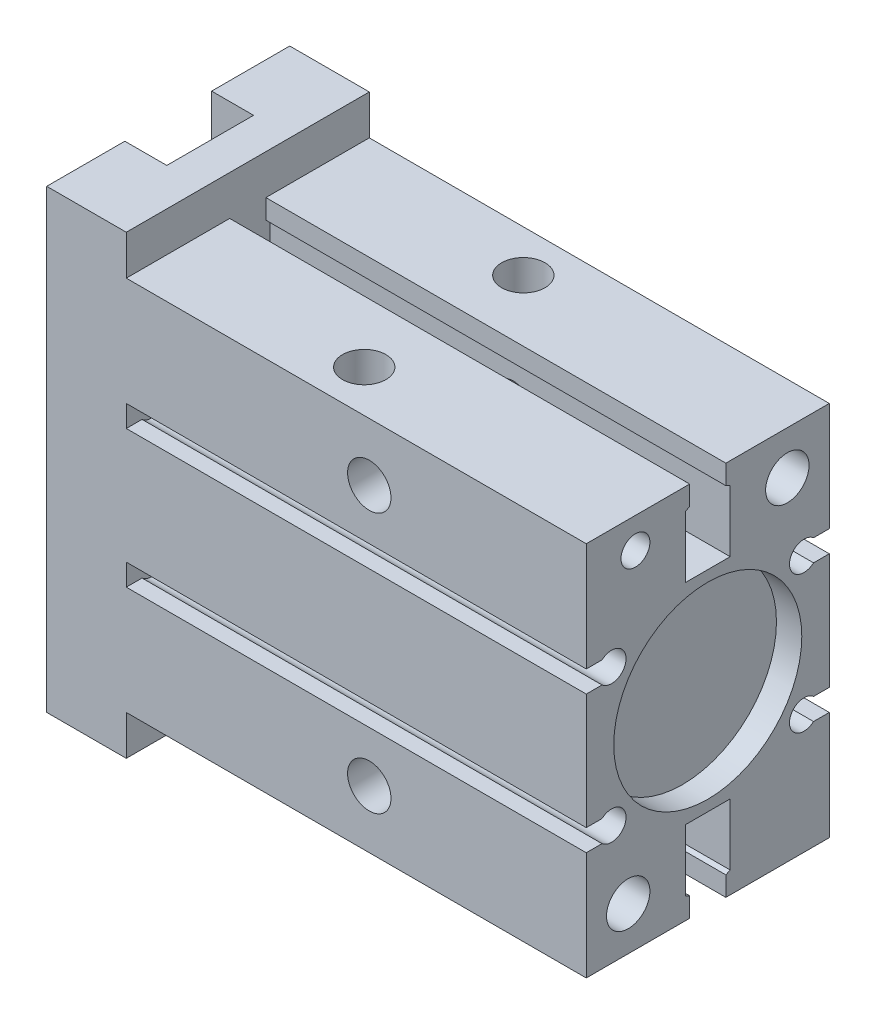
ISO-10303-21;
HEADER;
FILE_DESCRIPTION(('STEP AP214'),'2;1');
FILE_NAME('part.step','',(''),(''),'','','');
FILE_SCHEMA(('AUTOMOTIVE_DESIGN { 1 0 10303 214 1 1 1 1 }'));
ENDSEC;
DATA;
#1=APPLICATION_CONTEXT('core data for automotive mechanical design processes');
#2=APPLICATION_PROTOCOL_DEFINITION('international standard','automotive_design',2000,#1);
#3=PRODUCT_CONTEXT('',#1,'mechanical');
#4=PRODUCT('Part','Part','',(#3));
#5=PRODUCT_RELATED_PRODUCT_CATEGORY('part','',(#4));
#6=PRODUCT_DEFINITION_FORMATION('','',#4);
#7=PRODUCT_DEFINITION_CONTEXT('part definition',#1,'design');
#8=PRODUCT_DEFINITION('design','',#6,#7);
#9=PRODUCT_DEFINITION_SHAPE('','',#8);
#10=(LENGTH_UNIT() NAMED_UNIT(*) SI_UNIT(.MILLI.,.METRE.));
#11=(NAMED_UNIT(*) PLANE_ANGLE_UNIT() SI_UNIT($,.RADIAN.));
#12=(NAMED_UNIT(*) SI_UNIT($,.STERADIAN.) SOLID_ANGLE_UNIT());
#13=UNCERTAINTY_MEASURE_WITH_UNIT(LENGTH_MEASURE(1.E-05),#10,'distance_accuracy_value','');
#14=(GEOMETRIC_REPRESENTATION_CONTEXT(3) GLOBAL_UNCERTAINTY_ASSIGNED_CONTEXT((#13)) GLOBAL_UNIT_ASSIGNED_CONTEXT((#10,
#11,#12)) REPRESENTATION_CONTEXT('',''));
#15=CARTESIAN_POINT('',(0.,0.,0.));
#16=DIRECTION('',(0.,0.,1.));
#17=DIRECTION('',(1.,0.,0.));
#18=AXIS2_PLACEMENT_3D('',#15,#16,#17);
#19=CARTESIAN_POINT('',(0.,-26.,16.8));
#20=DIRECTION('',(0.,1.,0.));
#21=DIRECTION('',(-1.,0.,0.));
#22=AXIS2_PLACEMENT_3D('',#19,#20,#21);
#23=PLANE('',#22);
#24=CARTESIAN_POINT('',(40.1,-26.,10.));
#25=DIRECTION('',(0.,-1.,0.));
#26=DIRECTION('',(1.,0.,0.));
#27=AXIS2_PLACEMENT_3D('',#24,#25,#26);
#28=CIRCLE('',#27,2.49999999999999);
#29=CARTESIAN_POINT('',(42.6,-26.,10.));
#30=VERTEX_POINT('',#29);
#31=EDGE_CURVE('E416',#30,#30,#28,.T.);
#32=ORIENTED_EDGE('',*,*,#31,.F.);
#33=EDGE_LOOP('',(#32));
#34=FACE_BOUND('',#33,.T.);
#35=DIRECTION('',(0.,0.,-1.));
#36=VECTOR('',#35,1.);
#37=CARTESIAN_POINT('',(0.,-26.,16.8));
#38=LINE('',#37,#36);
#39=CARTESIAN_POINT('',(0.,-26.,16.8));
#40=VERTEX_POINT('',#39);
#41=CARTESIAN_POINT('',(0.,-26.,2.5));
#42=VERTEX_POINT('',#41);
#43=EDGE_CURVE('E11',#40,#42,#38,.T.);
#44=ORIENTED_EDGE('',*,*,#43,.T.);
#45=DIRECTION('',(1.,0.,0.));
#46=VECTOR('',#45,1.);
#47=CARTESIAN_POINT('',(-13.0648383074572,-26.,2.5));
#48=LINE('',#47,#46);
#49=CARTESIAN_POINT('',(63.6,-26.,2.5));
#50=VERTEX_POINT('',#49);
#51=EDGE_CURVE('E346',#42,#50,#48,.T.);
#52=ORIENTED_EDGE('',*,*,#51,.T.);
#53=DIRECTION('',(0.,0.,-1.));
#54=VECTOR('',#53,1.);
#55=CARTESIAN_POINT('',(63.6,-26.,16.8));
#56=LINE('',#55,#54);
#57=CARTESIAN_POINT('',(63.6,-26.,16.8));
#58=VERTEX_POINT('',#57);
#59=EDGE_CURVE('E700',#58,#50,#56,.T.);
#60=ORIENTED_EDGE('',*,*,#59,.F.);
#61=DIRECTION('',(1.,0.,0.));
#62=VECTOR('',#61,1.);
#63=CARTESIAN_POINT('',(0.,-26.,16.8));
#64=LINE('',#63,#62);
#65=EDGE_CURVE('E638',#40,#58,#64,.T.);
#66=ORIENTED_EDGE('',*,*,#65,.F.);
#67=EDGE_LOOP('',(#44,#52,#60,#66));
#68=FACE_BOUND('',#67,.T.);
#69=ADVANCED_FACE('F16',(#34,#68),#23,.F.);
#70=CARTESIAN_POINT('',(33.6,-18.,-16.8));
#71=DIRECTION('',(0.,0.,1.));
#72=DIRECTION('',(1.,0.,0.));
#73=AXIS2_PLACEMENT_3D('',#70,#71,#72);
#74=CYLINDRICAL_SURFACE('',#73,2.55);
#75=CARTESIAN_POINT('',(33.6,-18.,3.1));
#76=DIRECTION('',(0.,0.,1.));
#77=DIRECTION('',(0.,-1.,0.));
#78=AXIS2_PLACEMENT_3D('',#75,#76,#77);
#79=CIRCLE('',#78,2.55);
#80=CARTESIAN_POINT('',(33.6,-20.55,3.1));
#81=VERTEX_POINT('',#80);
#82=EDGE_CURVE('E20',#81,#81,#79,.F.);
#83=ORIENTED_EDGE('',*,*,#82,.T.);
#84=EDGE_LOOP('',(#83));
#85=FACE_BOUND('',#84,.T.);
#86=CARTESIAN_POINT('',(33.6,-18.,4.8));
#87=DIRECTION('',(0.,0.,1.));
#88=DIRECTION('',(1.,0.,0.));
#89=AXIS2_PLACEMENT_3D('',#86,#87,#88);
#90=CIRCLE('',#89,2.55);
#91=CARTESIAN_POINT('',(36.15,-18.,4.8));
#92=VERTEX_POINT('',#91);
#93=EDGE_CURVE('E451',#92,#92,#90,.T.);
#94=ORIENTED_EDGE('',*,*,#93,.T.);
#95=EDGE_LOOP('',(#94));
#96=FACE_BOUND('',#95,.T.);
#97=ADVANCED_FACE('F716',(#85,#96),#74,.F.);
#98=CARTESIAN_POINT('',(63.6,26.,16.8));
#99=DIRECTION('',(0.,-1.,0.));
#100=DIRECTION('',(1.,0.,0.));
#101=AXIS2_PLACEMENT_3D('',#98,#99,#100);
#102=PLANE('',#101);
#103=CARTESIAN_POINT('',(27.1,26.,11.));
#104=DIRECTION('',(0.,1.,0.));
#105=DIRECTION('',(-1.,0.,0.));
#106=AXIS2_PLACEMENT_3D('',#103,#104,#105);
#107=CIRCLE('',#106,3.);
#108=CARTESIAN_POINT('',(24.1,26.,11.));
#109=VERTEX_POINT('',#108);
#110=EDGE_CURVE('E483',#109,#109,#107,.T.);
#111=ORIENTED_EDGE('',*,*,#110,.F.);
#112=EDGE_LOOP('',(#111));
#113=FACE_BOUND('',#112,.T.);
#114=DIRECTION('',(0.,0.,-1.));
#115=VECTOR('',#114,1.);
#116=CARTESIAN_POINT('',(63.6,26.,16.8));
#117=LINE('',#116,#115);
#118=CARTESIAN_POINT('',(63.6,26.,16.8));
#119=VERTEX_POINT('',#118);
#120=CARTESIAN_POINT('',(63.6,26.,2.50000000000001));
#121=VERTEX_POINT('',#120);
#122=EDGE_CURVE('E696',#119,#121,#117,.T.);
#123=ORIENTED_EDGE('',*,*,#122,.T.);
#124=DIRECTION('',(1.,0.,0.));
#125=VECTOR('',#124,1.);
#126=CARTESIAN_POINT('',(-13.0648383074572,26.,2.50000000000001));
#127=LINE('',#126,#125);
#128=CARTESIAN_POINT('',(0.,26.,2.50000000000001));
#129=VERTEX_POINT('',#128);
#130=EDGE_CURVE('E404',#129,#121,#127,.T.);
#131=ORIENTED_EDGE('',*,*,#130,.F.);
#132=DIRECTION('',(0.,0.,-1.));
#133=VECTOR('',#132,1.);
#134=CARTESIAN_POINT('',(0.,26.,16.8));
#135=LINE('',#134,#133);
#136=CARTESIAN_POINT('',(0.,26.,16.8));
#137=VERTEX_POINT('',#136);
#138=EDGE_CURVE('E692',#137,#129,#135,.T.);
#139=ORIENTED_EDGE('',*,*,#138,.F.);
#140=DIRECTION('',(-1.,0.,0.));
#141=VECTOR('',#140,1.);
#142=CARTESIAN_POINT('',(63.6,26.,16.8));
#143=LINE('',#142,#141);
#144=EDGE_CURVE('E645',#119,#137,#143,.T.);
#145=ORIENTED_EDGE('',*,*,#144,.F.);
#146=EDGE_LOOP('',(#123,#131,#139,#145));
#147=FACE_BOUND('',#146,.T.);
#148=ADVANCED_FACE('F738',(#113,#147),#102,.F.);
#149=CARTESIAN_POINT('',(33.6,18.,-16.8));
#150=DIRECTION('',(0.,0.,1.));
#151=DIRECTION('',(1.,0.,0.));
#152=AXIS2_PLACEMENT_3D('',#149,#150,#151);
#153=CYLINDRICAL_SURFACE('',#152,2.55);
#154=CARTESIAN_POINT('',(33.6,18.,3.10000000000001));
#155=DIRECTION('',(0.,0.,1.));
#156=DIRECTION('',(0.,-1.,0.));
#157=AXIS2_PLACEMENT_3D('',#154,#155,#156);
#158=CIRCLE('',#157,2.55);
#159=CARTESIAN_POINT('',(33.6,15.45,3.1));
#160=VERTEX_POINT('',#159);
#161=EDGE_CURVE('E420',#160,#160,#158,.F.);
#162=ORIENTED_EDGE('',*,*,#161,.T.);
#163=EDGE_LOOP('',(#162));
#164=FACE_BOUND('',#163,.T.);
#165=CARTESIAN_POINT('',(33.6,18.,4.8));
#166=DIRECTION('',(0.,0.,1.));
#167=DIRECTION('',(1.,0.,0.));
#168=AXIS2_PLACEMENT_3D('',#165,#166,#167);
#169=CIRCLE('',#168,2.55);
#170=CARTESIAN_POINT('',(36.15,18.,4.8));
#171=VERTEX_POINT('',#170);
#172=EDGE_CURVE('E457',#171,#171,#169,.T.);
#173=ORIENTED_EDGE('',*,*,#172,.T.);
#174=EDGE_LOOP('',(#173));
#175=FACE_BOUND('',#174,.T.);
#176=ADVANCED_FACE('F1045',(#164,#175),#153,.F.);
#177=CARTESIAN_POINT('',(-11.,31.5,16.8));
#178=DIRECTION('',(1.,0.,0.));
#179=DIRECTION('',(0.,1.,0.));
#180=AXIS2_PLACEMENT_3D('',#177,#178,#179);
#181=PLANE('',#180);
#182=DIRECTION('',(0.,-1.,0.));
#183=VECTOR('',#182,1.);
#184=CARTESIAN_POINT('',(-11.,-31.5,6.));
#185=LINE('',#184,#183);
#186=CARTESIAN_POINT('',(-11.,31.5,6.));
#187=VERTEX_POINT('',#186);
#188=CARTESIAN_POINT('',(-11.,-31.5,6.));
#189=VERTEX_POINT('',#188);
#190=EDGE_CURVE('E424',#187,#189,#185,.T.);
#191=ORIENTED_EDGE('',*,*,#190,.T.);
#192=DIRECTION('',(0.,0.,-1.));
#193=VECTOR('',#192,1.);
#194=CARTESIAN_POINT('',(-11.,-31.5,16.8));
#195=LINE('',#194,#193);
#196=CARTESIAN_POINT('',(-11.,-31.5,16.8));
#197=VERTEX_POINT('',#196);
#198=EDGE_CURVE('E681',#197,#189,#195,.T.);
#199=ORIENTED_EDGE('',*,*,#198,.F.);
#200=DIRECTION('',(0.,-1.,0.));
#201=VECTOR('',#200,1.);
#202=CARTESIAN_POINT('',(-11.,31.5,16.8));
#203=LINE('',#202,#201);
#204=CARTESIAN_POINT('',(-11.,31.5,16.8));
#205=VERTEX_POINT('',#204);
#206=EDGE_CURVE('E652',#205,#197,#203,.T.);
#207=ORIENTED_EDGE('',*,*,#206,.F.);
#208=DIRECTION('',(0.,0.,-1.));
#209=VECTOR('',#208,1.);
#210=CARTESIAN_POINT('',(-11.,31.5,16.8));
#211=LINE('',#210,#209);
#212=EDGE_CURVE('E685',#205,#187,#211,.T.);
#213=ORIENTED_EDGE('',*,*,#212,.T.);
#214=EDGE_LOOP('',(#191,#199,#207,#213));
#215=FACE_BOUND('',#214,.T.);
#216=ADVANCED_FACE('F753',(#215),#181,.F.);
#217=CARTESIAN_POINT('',(0.,-31.5,16.8));
#218=DIRECTION('',(-1.,0.,0.));
#219=DIRECTION('',(0.,-1.,0.));
#220=AXIS2_PLACEMENT_3D('',#217,#218,#219);
#221=PLANE('',#220);
#222=DIRECTION('',(0.,1.,0.));
#223=VECTOR('',#222,1.);
#224=CARTESIAN_POINT('',(0.,-31.5,-16.8));
#225=LINE('',#224,#223);
#226=CARTESIAN_POINT('',(0.,-31.5,-16.8));
#227=VERTEX_POINT('',#226);
#228=CARTESIAN_POINT('',(0.,-26.,-16.8));
#229=VERTEX_POINT('',#228);
#230=EDGE_CURVE('E632',#227,#229,#225,.T.);
#231=ORIENTED_EDGE('',*,*,#230,.T.);
#232=CARTESIAN_POINT('',(0.,-26.,-2.5));
#233=VERTEX_POINT('',#232);
#234=EDGE_CURVE('E25',#233,#229,#38,.T.);
#235=ORIENTED_EDGE('',*,*,#234,.F.);
#236=DIRECTION('',(0.,1.,0.));
#237=VECTOR('',#236,1.);
#238=CARTESIAN_POINT('',(0.,-23.3,-2.5));
#239=LINE('',#238,#237);
#240=CARTESIAN_POINT('',(0.,-23.3,-2.5));
#241=VERTEX_POINT('',#240);
#242=EDGE_CURVE('E341',#233,#241,#239,.T.);
#243=ORIENTED_EDGE('',*,*,#242,.T.);
#244=DIRECTION('',(0.,0.422618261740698,-0.90630778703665));
#245=VECTOR('',#244,1.);
#246=CARTESIAN_POINT('',(0.,-23.020215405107,-3.1));
#247=LINE('',#246,#245);
#248=CARTESIAN_POINT('',(0.,-23.020215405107,-3.1));
#249=VERTEX_POINT('',#248);
#250=EDGE_CURVE('E337',#241,#249,#247,.T.);
#251=ORIENTED_EDGE('',*,*,#250,.T.);
#252=DIRECTION('',(0.,1.,0.));
#253=VECTOR('',#252,1.);
#254=CARTESIAN_POINT('',(0.,-14.5,-3.1));
#255=LINE('',#254,#253);
#256=CARTESIAN_POINT('',(0.,-14.5,-3.1));
#257=VERTEX_POINT('',#256);
#258=EDGE_CURVE('E334',#249,#257,#255,.T.);
#259=ORIENTED_EDGE('',*,*,#258,.T.);
#260=DIRECTION('',(0.,0.,1.));
#261=VECTOR('',#260,1.);
#262=CARTESIAN_POINT('',(0.,-14.5,3.1));
#263=LINE('',#262,#261);
#264=CARTESIAN_POINT('',(0.,-14.5,3.1));
#265=VERTEX_POINT('',#264);
#266=EDGE_CURVE('E322',#257,#265,#263,.T.);
#267=ORIENTED_EDGE('',*,*,#266,.T.);
#268=DIRECTION('',(0.,-1.,0.));
#269=VECTOR('',#268,1.);
#270=CARTESIAN_POINT('',(0.,-23.020215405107,3.1));
#271=LINE('',#270,#269);
#272=CARTESIAN_POINT('',(0.,-23.020215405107,3.1));
#273=VERTEX_POINT('',#272);
#274=EDGE_CURVE('E314',#265,#273,#271,.T.);
#275=ORIENTED_EDGE('',*,*,#274,.T.);
#276=DIRECTION('',(0.,-0.422618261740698,-0.90630778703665));
#277=VECTOR('',#276,1.);
#278=CARTESIAN_POINT('',(0.,-23.3,2.5));
#279=LINE('',#278,#277);
#280=CARTESIAN_POINT('',(0.,-23.3,2.5));
#281=VERTEX_POINT('',#280);
#282=EDGE_CURVE('E300',#273,#281,#279,.T.);
#283=ORIENTED_EDGE('',*,*,#282,.T.);
#284=DIRECTION('',(0.,-1.,0.));
#285=VECTOR('',#284,1.);
#286=CARTESIAN_POINT('',(0.,-26.,2.5));
#287=LINE('',#286,#285);
#288=EDGE_CURVE('E345',#281,#42,#287,.T.);
#289=ORIENTED_EDGE('',*,*,#288,.T.);
#290=ORIENTED_EDGE('',*,*,#43,.F.);
#291=DIRECTION('',(0.,1.,0.));
#292=VECTOR('',#291,1.);
#293=CARTESIAN_POINT('',(0.,-31.5,16.8));
#294=LINE('',#293,#292);
#295=CARTESIAN_POINT('',(0.,-31.5,16.8));
#296=VERTEX_POINT('',#295);
#297=EDGE_CURVE('E635',#296,#40,#294,.T.);
#298=ORIENTED_EDGE('',*,*,#297,.F.);
#299=DIRECTION('',(0.,0.,-1.));
#300=VECTOR('',#299,1.);
#301=CARTESIAN_POINT('',(0.,-31.5,16.8));
#302=LINE('',#301,#300);
#303=EDGE_CURVE('E656',#296,#227,#302,.T.);
#304=ORIENTED_EDGE('',*,*,#303,.T.);
#305=EDGE_LOOP('',(#231,#235,#243,#251,#259,#267,#275,#283,#289,#290,#298,#304));
#306=FACE_BOUND('',#305,.T.);
#307=ADVANCED_FACE('F18',(#306),#221,.F.);
#308=CARTESIAN_POINT('',(52.9,-26.,-10.));
#309=DIRECTION('',(0.,-1.,0.));
#310=DIRECTION('',(1.,0.,0.));
#311=AXIS2_PLACEMENT_3D('',#308,#309,#310);
#312=CIRCLE('',#311,2.49999999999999);
#313=CARTESIAN_POINT('',(55.4,-26.,-10.));
#314=VERTEX_POINT('',#313);
#315=EDGE_CURVE('E417',#314,#314,#312,.T.);
#316=ORIENTED_EDGE('',*,*,#315,.F.);
#317=EDGE_LOOP('',(#316));
#318=FACE_BOUND('',#317,.T.);
#319=CARTESIAN_POINT('',(63.6,-26.,-2.5));
#320=VERTEX_POINT('',#319);
#321=CARTESIAN_POINT('',(63.6,-26.,-16.8));
#322=VERTEX_POINT('',#321);
#323=EDGE_CURVE('E699',#320,#322,#56,.T.);
#324=ORIENTED_EDGE('',*,*,#323,.F.);
#325=DIRECTION('',(1.,0.,0.));
#326=VECTOR('',#325,1.);
#327=CARTESIAN_POINT('',(-13.0648383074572,-26.,-2.5));
#328=LINE('',#327,#326);
#329=EDGE_CURVE('E344',#233,#320,#328,.T.);
#330=ORIENTED_EDGE('',*,*,#329,.F.);
#331=ORIENTED_EDGE('',*,*,#234,.T.);
#332=DIRECTION('',(1.,0.,0.));
#333=VECTOR('',#332,1.);
#334=CARTESIAN_POINT('',(0.,-26.,-16.8));
#335=LINE('',#334,#333);
#336=EDGE_CURVE('E658',#229,#322,#335,.T.);
#337=ORIENTED_EDGE('',*,*,#336,.T.);
#338=EDGE_LOOP('',(#324,#330,#331,#337));
#339=FACE_BOUND('',#338,.T.);
#340=ADVANCED_FACE('F734',(#318,#339),#23,.F.);
#341=CARTESIAN_POINT('',(63.6,-26.,16.8));
#342=DIRECTION('',(-1.,0.,0.));
#343=DIRECTION('',(0.,0.,1.));
#344=AXIS2_PLACEMENT_3D('',#341,#342,#343);
#345=PLANE('',#344);
#346=ORIENTED_EDGE('',*,*,#59,.T.);
#347=DIRECTION('',(0.,-1.,0.));
#348=VECTOR('',#347,1.);
#349=CARTESIAN_POINT('',(63.6,-26.,2.5));
#350=LINE('',#349,#348);
#351=CARTESIAN_POINT('',(63.6,-23.3,2.5));
#352=VERTEX_POINT('',#351);
#353=EDGE_CURVE('E770',#352,#50,#350,.T.);
#354=ORIENTED_EDGE('',*,*,#353,.F.);
#355=DIRECTION('',(0.,-0.422618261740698,-0.90630778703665));
#356=VECTOR('',#355,1.);
#357=CARTESIAN_POINT('',(63.6,-23.3,2.5));
#358=LINE('',#357,#356);
#359=CARTESIAN_POINT('',(63.6,-23.020215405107,3.1));
#360=VERTEX_POINT('',#359);
#361=EDGE_CURVE('E773',#360,#352,#358,.T.);
#362=ORIENTED_EDGE('',*,*,#361,.F.);
#363=DIRECTION('',(0.,-1.,0.));
#364=VECTOR('',#363,1.);
#365=CARTESIAN_POINT('',(63.6,-23.020215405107,3.1));
#366=LINE('',#365,#364);
#367=CARTESIAN_POINT('',(63.6,-14.5,3.1));
#368=VERTEX_POINT('',#367);
#369=EDGE_CURVE('E317',#368,#360,#366,.T.);
#370=ORIENTED_EDGE('',*,*,#369,.F.);
#371=DIRECTION('',(0.,0.,1.));
#372=VECTOR('',#371,1.);
#373=CARTESIAN_POINT('',(63.6,-14.5,3.1));
#374=LINE('',#373,#372);
#375=CARTESIAN_POINT('',(63.6,-14.5,-3.1));
#376=VERTEX_POINT('',#375);
#377=EDGE_CURVE('E329',#376,#368,#374,.T.);
#378=ORIENTED_EDGE('',*,*,#377,.F.);
#379=DIRECTION('',(0.,1.,0.));
#380=VECTOR('',#379,1.);
#381=CARTESIAN_POINT('',(63.6,-14.5,-3.1));
#382=LINE('',#381,#380);
#383=CARTESIAN_POINT('',(63.6,-23.020215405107,-3.1));
#384=VERTEX_POINT('',#383);
#385=EDGE_CURVE('E33',#384,#376,#382,.T.);
#386=ORIENTED_EDGE('',*,*,#385,.F.);
#387=DIRECTION('',(0.,0.422618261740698,-0.90630778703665));
#388=VECTOR('',#387,1.);
#389=CARTESIAN_POINT('',(63.6,-23.020215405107,-3.1));
#390=LINE('',#389,#388);
#391=CARTESIAN_POINT('',(63.6,-23.3,-2.5));
#392=VERTEX_POINT('',#391);
#393=EDGE_CURVE('E325',#392,#384,#390,.T.);
#394=ORIENTED_EDGE('',*,*,#393,.F.);
#395=DIRECTION('',(0.,1.,0.));
#396=VECTOR('',#395,1.);
#397=CARTESIAN_POINT('',(63.6,-23.3,-2.5));
#398=LINE('',#397,#396);
#399=EDGE_CURVE('E766',#320,#392,#398,.T.);
#400=ORIENTED_EDGE('',*,*,#399,.F.);
#401=ORIENTED_EDGE('',*,*,#323,.T.);
#402=DIRECTION('',(0.,1.,0.));
#403=VECTOR('',#402,1.);
#404=CARTESIAN_POINT('',(63.6,-26.,-16.8));
#405=LINE('',#404,#403);
#406=CARTESIAN_POINT('',(63.6,-11.,-16.8));
#407=VERTEX_POINT('',#406);
#408=EDGE_CURVE('E662',#322,#407,#405,.T.);
#409=ORIENTED_EDGE('',*,*,#408,.T.);
#410=DIRECTION('',(0.,0.,-1.));
#411=VECTOR('',#410,1.);
#412=CARTESIAN_POINT('',(63.6,-11.,-14.6228756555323));
#413=LINE('',#412,#411);
#414=CARTESIAN_POINT('',(63.6,-11.,-14.6228756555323));
#415=VERTEX_POINT('',#414);
#416=EDGE_CURVE('E578',#415,#407,#413,.T.);
#417=ORIENTED_EDGE('',*,*,#416,.F.);
#418=CARTESIAN_POINT('',(63.6,-9.49999999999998,-13.3));
#419=DIRECTION('',(1.,0.,0.));
#420=DIRECTION('',(0.,1.,0.));
#421=AXIS2_PLACEMENT_3D('',#418,#419,#420);
#422=CIRCLE('',#421,2.);
#423=CARTESIAN_POINT('',(63.6,-7.99999999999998,-14.6228756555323));
#424=VERTEX_POINT('',#423);
#425=EDGE_CURVE('E513',#424,#415,#422,.T.);
#426=ORIENTED_EDGE('',*,*,#425,.F.);
#427=DIRECTION('',(0.,0.,1.));
#428=VECTOR('',#427,1.);
#429=CARTESIAN_POINT('',(63.6,-7.99999999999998,-14.6228756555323));
#430=LINE('',#429,#428);
#431=CARTESIAN_POINT('',(63.6,-7.99999999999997,-16.8));
#432=VERTEX_POINT('',#431);
#433=EDGE_CURVE('E574',#432,#424,#430,.T.);
#434=ORIENTED_EDGE('',*,*,#433,.F.);
#435=CARTESIAN_POINT('',(63.6,8.00000000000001,-16.8));
#436=VERTEX_POINT('',#435);
#437=EDGE_CURVE('E666',#432,#436,#405,.T.);
#438=ORIENTED_EDGE('',*,*,#437,.T.);
#439=DIRECTION('',(0.,0.,-1.));
#440=VECTOR('',#439,1.);
#441=CARTESIAN_POINT('',(63.6,8.00000000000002,-14.6228756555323));
#442=LINE('',#441,#440);
#443=CARTESIAN_POINT('',(63.6,8.00000000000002,-14.6228756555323));
#444=VERTEX_POINT('',#443);
#445=EDGE_CURVE('E550',#444,#436,#442,.T.);
#446=ORIENTED_EDGE('',*,*,#445,.F.);
#447=CARTESIAN_POINT('',(63.6,9.50000000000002,-13.3));
#448=DIRECTION('',(1.,0.,0.));
#449=DIRECTION('',(0.,1.,0.));
#450=AXIS2_PLACEMENT_3D('',#447,#448,#449);
#451=CIRCLE('',#450,2.);
#452=CARTESIAN_POINT('',(63.6,11.,-14.6228756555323));
#453=VERTEX_POINT('',#452);
#454=EDGE_CURVE('E552',#453,#444,#451,.T.);
#455=ORIENTED_EDGE('',*,*,#454,.F.);
#456=DIRECTION('',(0.,0.,1.));
#457=VECTOR('',#456,1.);
#458=CARTESIAN_POINT('',(63.6,11.,-14.6228756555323));
#459=LINE('',#458,#457);
#460=CARTESIAN_POINT('',(63.6,11.,-16.8));
#461=VERTEX_POINT('',#460);
#462=EDGE_CURVE('E546',#461,#453,#459,.T.);
#463=ORIENTED_EDGE('',*,*,#462,.F.);
#464=CARTESIAN_POINT('',(63.6,26.,-16.8));
#465=VERTEX_POINT('',#464);
#466=EDGE_CURVE('E661',#461,#465,#405,.T.);
#467=ORIENTED_EDGE('',*,*,#466,.T.);
#468=CARTESIAN_POINT('',(63.6,26.,-2.49999999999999));
#469=VERTEX_POINT('',#468);
#470=EDGE_CURVE('E695',#469,#465,#117,.T.);
#471=ORIENTED_EDGE('',*,*,#470,.F.);
#472=DIRECTION('',(0.,1.,0.));
#473=VECTOR('',#472,1.);
#474=CARTESIAN_POINT('',(63.6,23.3,-2.5));
#475=LINE('',#474,#473);
#476=CARTESIAN_POINT('',(63.6,23.3,-2.5));
#477=VERTEX_POINT('',#476);
#478=EDGE_CURVE('E357',#477,#469,#475,.T.);
#479=ORIENTED_EDGE('',*,*,#478,.F.);
#480=DIRECTION('',(0.,0.422618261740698,0.90630778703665));
#481=VECTOR('',#480,1.);
#482=CARTESIAN_POINT('',(63.6,23.020215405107,-3.1));
#483=LINE('',#482,#481);
#484=CARTESIAN_POINT('',(63.6,23.020215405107,-3.1));
#485=VERTEX_POINT('',#484);
#486=EDGE_CURVE('E360',#485,#477,#483,.T.);
#487=ORIENTED_EDGE('',*,*,#486,.F.);
#488=DIRECTION('',(0.,1.,0.));
#489=VECTOR('',#488,1.);
#490=CARTESIAN_POINT('',(63.6,14.5,-3.1));
#491=LINE('',#490,#489);
#492=CARTESIAN_POINT('',(63.6,14.5,-3.1));
#493=VERTEX_POINT('',#492);
#494=EDGE_CURVE('E363',#493,#485,#491,.T.);
#495=ORIENTED_EDGE('',*,*,#494,.F.);
#496=DIRECTION('',(0.,0.,-1.));
#497=VECTOR('',#496,1.);
#498=CARTESIAN_POINT('',(63.6,14.5,3.1));
#499=LINE('',#498,#497);
#500=CARTESIAN_POINT('',(63.6,14.5,3.1));
#501=VERTEX_POINT('',#500);
#502=EDGE_CURVE('E366',#501,#493,#499,.T.);
#503=ORIENTED_EDGE('',*,*,#502,.F.);
#504=DIRECTION('',(0.,-1.,0.));
#505=VECTOR('',#504,1.);
#506=CARTESIAN_POINT('',(63.6,23.020215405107,3.1));
#507=LINE('',#506,#505);
#508=CARTESIAN_POINT('',(63.6,23.020215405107,3.1));
#509=VERTEX_POINT('',#508);
#510=EDGE_CURVE('E369',#509,#501,#507,.T.);
#511=ORIENTED_EDGE('',*,*,#510,.F.);
#512=DIRECTION('',(0.,-0.422618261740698,0.90630778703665));
#513=VECTOR('',#512,1.);
#514=CARTESIAN_POINT('',(63.6,23.3,2.50000000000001));
#515=LINE('',#514,#513);
#516=CARTESIAN_POINT('',(63.6,23.3,2.50000000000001));
#517=VERTEX_POINT('',#516);
#518=EDGE_CURVE('E372',#517,#509,#515,.T.);
#519=ORIENTED_EDGE('',*,*,#518,.F.);
#520=DIRECTION('',(0.,-1.,0.));
#521=VECTOR('',#520,1.);
#522=CARTESIAN_POINT('',(63.6,26.,2.50000000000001));
#523=LINE('',#522,#521);
#524=EDGE_CURVE('E375',#121,#517,#523,.T.);
#525=ORIENTED_EDGE('',*,*,#524,.F.);
#526=ORIENTED_EDGE('',*,*,#122,.F.);
#527=DIRECTION('',(0.,1.,0.));
#528=VECTOR('',#527,1.);
#529=CARTESIAN_POINT('',(63.6,-26.,16.8));
#530=LINE('',#529,#528);
#531=CARTESIAN_POINT('',(63.6,11.,16.8));
#532=VERTEX_POINT('',#531);
#533=EDGE_CURVE('E641',#532,#119,#530,.T.);
#534=ORIENTED_EDGE('',*,*,#533,.F.);
#535=DIRECTION('',(0.,0.,1.));
#536=VECTOR('',#535,1.);
#537=CARTESIAN_POINT('',(63.6,11.,14.6228756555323));
#538=LINE('',#537,#536);
#539=CARTESIAN_POINT('',(63.6,11.,14.6228756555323));
#540=VERTEX_POINT('',#539);
#541=EDGE_CURVE('E604',#540,#532,#538,.T.);
#542=ORIENTED_EDGE('',*,*,#541,.F.);
#543=CARTESIAN_POINT('',(63.6,9.50000000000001,13.3));
#544=DIRECTION('',(1.,0.,0.));
#545=DIRECTION('',(0.,1.,0.));
#546=AXIS2_PLACEMENT_3D('',#543,#544,#545);
#547=CIRCLE('',#546,2.);
#548=CARTESIAN_POINT('',(63.6,8.00000000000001,14.6228756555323));
#549=VERTEX_POINT('',#548);
#550=EDGE_CURVE('E545',#549,#540,#547,.T.);
#551=ORIENTED_EDGE('',*,*,#550,.F.);
#552=DIRECTION('',(0.,0.,-1.));
#553=VECTOR('',#552,1.);
#554=CARTESIAN_POINT('',(63.6,8.00000000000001,14.6228756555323));
#555=LINE('',#554,#553);
#556=CARTESIAN_POINT('',(63.6,8.00000000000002,16.8));
#557=VERTEX_POINT('',#556);
#558=EDGE_CURVE('E600',#557,#549,#555,.T.);
#559=ORIENTED_EDGE('',*,*,#558,.F.);
#560=CARTESIAN_POINT('',(63.6,-7.99999999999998,16.8));
#561=VERTEX_POINT('',#560);
#562=EDGE_CURVE('E646',#561,#557,#530,.T.);
#563=ORIENTED_EDGE('',*,*,#562,.F.);
#564=DIRECTION('',(0.,0.,1.));
#565=VECTOR('',#564,1.);
#566=CARTESIAN_POINT('',(63.6,-7.99999999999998,14.6228756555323));
#567=LINE('',#566,#565);
#568=CARTESIAN_POINT('',(63.6,-7.99999999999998,14.6228756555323));
#569=VERTEX_POINT('',#568);
#570=EDGE_CURVE('E520',#569,#561,#567,.T.);
#571=ORIENTED_EDGE('',*,*,#570,.F.);
#572=CARTESIAN_POINT('',(63.6,-9.49999999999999,13.3));
#573=DIRECTION('',(1.,0.,0.));
#574=DIRECTION('',(0.,1.,0.));
#575=AXIS2_PLACEMENT_3D('',#572,#573,#574);
#576=CIRCLE('',#575,2.);
#577=CARTESIAN_POINT('',(63.6,-11.,14.6228756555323));
#578=VERTEX_POINT('',#577);
#579=EDGE_CURVE('E522',#578,#569,#576,.T.);
#580=ORIENTED_EDGE('',*,*,#579,.F.);
#581=DIRECTION('',(0.,0.,-1.));
#582=VECTOR('',#581,1.);
#583=CARTESIAN_POINT('',(63.6,-11.,14.6228756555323));
#584=LINE('',#583,#582);
#585=CARTESIAN_POINT('',(63.6,-11.,16.8));
#586=VERTEX_POINT('',#585);
#587=EDGE_CURVE('E516',#586,#578,#584,.T.);
#588=ORIENTED_EDGE('',*,*,#587,.F.);
#589=EDGE_CURVE('E642',#58,#586,#530,.T.);
#590=ORIENTED_EDGE('',*,*,#589,.F.);
#591=EDGE_LOOP('',(#346,#354,#362,#370,#378,#386,#394,#400,#401,#409,#417,#426,#434,#438,#446,
#455,#463,#467,#471,#479,#487,#495,#503,#511,#519,#525,#526,#534,#542,#551,#559,#563,#571,#580,
#588,#590));
#592=FACE_BOUND('',#591,.T.);
#593=CARTESIAN_POINT('',(63.6,20.,-11.));
#594=DIRECTION('',(1.,0.,0.));
#595=DIRECTION('',(0.,1.,0.));
#596=AXIS2_PLACEMENT_3D('',#593,#594,#595);
#597=CIRCLE('',#596,3.);
#598=CARTESIAN_POINT('',(63.6,23.,-11.));
#599=VERTEX_POINT('',#598);
#600=EDGE_CURVE('E495',#599,#599,#597,.T.);
#601=ORIENTED_EDGE('',*,*,#600,.F.);
#602=EDGE_LOOP('',(#601));
#603=FACE_BOUND('',#602,.T.);
#604=CARTESIAN_POINT('',(63.6,-20.,11.));
#605=DIRECTION('',(1.,0.,0.));
#606=DIRECTION('',(0.,1.,0.));
#607=AXIS2_PLACEMENT_3D('',#604,#605,#606);
#608=CIRCLE('',#607,3.);
#609=CARTESIAN_POINT('',(63.6,-17.,11.));
#610=VERTEX_POINT('',#609);
#611=EDGE_CURVE('E501',#610,#610,#608,.T.);
#612=ORIENTED_EDGE('',*,*,#611,.F.);
#613=EDGE_LOOP('',(#612));
#614=FACE_BOUND('',#613,.T.);
#615=CARTESIAN_POINT('',(63.6,21.8,10.));
#616=DIRECTION('',(1.,0.,0.));
#617=DIRECTION('',(0.,1.,0.));
#618=AXIS2_PLACEMENT_3D('',#615,#616,#617);
#619=CIRCLE('',#618,2.);
#620=CARTESIAN_POINT('',(63.6,23.8,10.));
#621=VERTEX_POINT('',#620);
#622=EDGE_CURVE('E507',#621,#621,#619,.T.);
#623=ORIENTED_EDGE('',*,*,#622,.F.);
#624=EDGE_LOOP('',(#623));
#625=FACE_BOUND('',#624,.T.);
#626=CARTESIAN_POINT('',(63.6,0.,0.));
#627=DIRECTION('',(1.,0.,0.));
#628=DIRECTION('',(0.,1.,0.));
#629=AXIS2_PLACEMENT_3D('',#626,#627,#628);
#630=CIRCLE('',#629,13.);
#631=CARTESIAN_POINT('',(63.6,13.,0.));
#632=VERTEX_POINT('',#631);
#633=EDGE_CURVE('E628',#632,#632,#630,.T.);
#634=ORIENTED_EDGE('',*,*,#633,.F.);
#635=EDGE_LOOP('',(#634));
#636=FACE_BOUND('',#635,.T.);
#637=ADVANCED_FACE('F745',(#592,#603,#614,#625,#636),#345,.F.);
#638=CARTESIAN_POINT('',(27.1,26.,-11.));
#639=DIRECTION('',(0.,1.,0.));
#640=DIRECTION('',(-1.,0.,0.));
#641=AXIS2_PLACEMENT_3D('',#638,#639,#640);
#642=CIRCLE('',#641,3.);
#643=CARTESIAN_POINT('',(24.1,26.,-11.));
#644=VERTEX_POINT('',#643);
#645=EDGE_CURVE('E489',#644,#644,#642,.T.);
#646=ORIENTED_EDGE('',*,*,#645,.F.);
#647=EDGE_LOOP('',(#646));
#648=FACE_BOUND('',#647,.T.);
#649=CARTESIAN_POINT('',(0.,26.,-2.5));
#650=VERTEX_POINT('',#649);
#651=CARTESIAN_POINT('',(0.,26.,-16.8));
#652=VERTEX_POINT('',#651);
#653=EDGE_CURVE('E691',#650,#652,#135,.T.);
#654=ORIENTED_EDGE('',*,*,#653,.F.);
#655=DIRECTION('',(1.,0.,0.));
#656=VECTOR('',#655,1.);
#657=CARTESIAN_POINT('',(-13.0648383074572,26.,-2.49999999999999));
#658=LINE('',#657,#656);
#659=EDGE_CURVE('E382',#650,#469,#658,.T.);
#660=ORIENTED_EDGE('',*,*,#659,.T.);
#661=ORIENTED_EDGE('',*,*,#470,.T.);
#662=DIRECTION('',(-1.,0.,0.));
#663=VECTOR('',#662,1.);
#664=CARTESIAN_POINT('',(63.6,26.,-16.8));
#665=LINE('',#664,#663);
#666=EDGE_CURVE('E665',#465,#652,#665,.T.);
#667=ORIENTED_EDGE('',*,*,#666,.T.);
#668=EDGE_LOOP('',(#654,#660,#661,#667));
#669=FACE_BOUND('',#668,.T.);
#670=ADVANCED_FACE('F751',(#648,#669),#102,.F.);
#671=CARTESIAN_POINT('',(0.,26.,16.8));
#672=DIRECTION('',(-1.,0.,0.));
#673=DIRECTION('',(0.,0.,1.));
#674=AXIS2_PLACEMENT_3D('',#671,#672,#673);
#675=PLANE('',#674);
#676=DIRECTION('',(0.,1.,0.));
#677=VECTOR('',#676,1.);
#678=CARTESIAN_POINT('',(0.,26.,-16.8));
#679=LINE('',#678,#677);
#680=CARTESIAN_POINT('',(0.,31.5,-16.8));
#681=VERTEX_POINT('',#680);
#682=EDGE_CURVE('E669',#652,#681,#679,.T.);
#683=ORIENTED_EDGE('',*,*,#682,.T.);
#684=DIRECTION('',(0.,0.,-1.));
#685=VECTOR('',#684,1.);
#686=CARTESIAN_POINT('',(0.,31.5,16.8));
#687=LINE('',#686,#685);
#688=CARTESIAN_POINT('',(0.,31.5,16.8));
#689=VERTEX_POINT('',#688);
#690=EDGE_CURVE('E688',#689,#681,#687,.T.);
#691=ORIENTED_EDGE('',*,*,#690,.F.);
#692=DIRECTION('',(0.,1.,0.));
#693=VECTOR('',#692,1.);
#694=CARTESIAN_POINT('',(0.,26.,16.8));
#695=LINE('',#694,#693);
#696=EDGE_CURVE('E648',#137,#689,#695,.T.);
#697=ORIENTED_EDGE('',*,*,#696,.F.);
#698=ORIENTED_EDGE('',*,*,#138,.T.);
#699=DIRECTION('',(0.,-1.,0.));
#700=VECTOR('',#699,1.);
#701=CARTESIAN_POINT('',(0.,26.,2.50000000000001));
#702=LINE('',#701,#700);
#703=CARTESIAN_POINT('',(0.,23.3,2.50000000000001));
#704=VERTEX_POINT('',#703);
#705=EDGE_CURVE('E359',#129,#704,#702,.T.);
#706=ORIENTED_EDGE('',*,*,#705,.T.);
#707=DIRECTION('',(0.,-0.422618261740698,0.90630778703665));
#708=VECTOR('',#707,1.);
#709=CARTESIAN_POINT('',(0.,23.3,2.50000000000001));
#710=LINE('',#709,#708);
#711=CARTESIAN_POINT('',(0.,23.020215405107,3.1));
#712=VERTEX_POINT('',#711);
#713=EDGE_CURVE('E399',#704,#712,#710,.T.);
#714=ORIENTED_EDGE('',*,*,#713,.T.);
#715=DIRECTION('',(0.,-1.,0.));
#716=VECTOR('',#715,1.);
#717=CARTESIAN_POINT('',(0.,23.020215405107,3.1));
#718=LINE('',#717,#716);
#719=CARTESIAN_POINT('',(0.,14.5,3.1));
#720=VERTEX_POINT('',#719);
#721=EDGE_CURVE('E395',#712,#720,#718,.T.);
#722=ORIENTED_EDGE('',*,*,#721,.T.);
#723=DIRECTION('',(0.,0.,-1.));
#724=VECTOR('',#723,1.);
#725=CARTESIAN_POINT('',(0.,14.5,3.1));
#726=LINE('',#725,#724);
#727=CARTESIAN_POINT('',(0.,14.5,-3.1));
#728=VERTEX_POINT('',#727);
#729=EDGE_CURVE('E391',#720,#728,#726,.T.);
#730=ORIENTED_EDGE('',*,*,#729,.T.);
#731=DIRECTION('',(0.,1.,0.));
#732=VECTOR('',#731,1.);
#733=CARTESIAN_POINT('',(0.,14.5,-3.1));
#734=LINE('',#733,#732);
#735=CARTESIAN_POINT('',(0.,23.020215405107,-3.1));
#736=VERTEX_POINT('',#735);
#737=EDGE_CURVE('E387',#728,#736,#734,.T.);
#738=ORIENTED_EDGE('',*,*,#737,.T.);
#739=DIRECTION('',(0.,0.422618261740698,0.90630778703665));
#740=VECTOR('',#739,1.);
#741=CARTESIAN_POINT('',(0.,23.020215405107,-3.1));
#742=LINE('',#741,#740);
#743=CARTESIAN_POINT('',(0.,23.3,-2.5));
#744=VERTEX_POINT('',#743);
#745=EDGE_CURVE('E384',#736,#744,#742,.T.);
#746=ORIENTED_EDGE('',*,*,#745,.T.);
#747=DIRECTION('',(0.,1.,0.));
#748=VECTOR('',#747,1.);
#749=CARTESIAN_POINT('',(0.,23.3,-2.5));
#750=LINE('',#749,#748);
#751=EDGE_CURVE('E41',#744,#650,#750,.T.);
#752=ORIENTED_EDGE('',*,*,#751,.T.);
#753=ORIENTED_EDGE('',*,*,#653,.T.);
#754=EDGE_LOOP('',(#683,#691,#697,#698,#706,#714,#722,#730,#738,#746,#752,#753));
#755=FACE_BOUND('',#754,.T.);
#756=ADVANCED_FACE('F1449',(#755),#675,.F.);
#757=CARTESIAN_POINT('',(0.,31.5,16.8));
#758=DIRECTION('',(0.,-1.,0.));
#759=DIRECTION('',(0.,0.,-1.));
#760=AXIS2_PLACEMENT_3D('',#757,#758,#759);
#761=PLANE('',#760);
#762=CARTESIAN_POINT('',(-11.,31.5,-6.));
#763=VERTEX_POINT('',#762);
#764=CARTESIAN_POINT('',(-11.,31.5,-16.8));
#765=VERTEX_POINT('',#764);
#766=EDGE_CURVE('E684',#763,#765,#211,.T.);
#767=ORIENTED_EDGE('',*,*,#766,.F.);
#768=DIRECTION('',(-1.,0.,0.));
#769=VECTOR('',#768,1.);
#770=CARTESIAN_POINT('',(-11.,31.5,-6.));
#771=LINE('',#770,#769);
#772=CARTESIAN_POINT('',(-5.20000000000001,31.5,-6.));
#773=VERTEX_POINT('',#772);
#774=EDGE_CURVE('E436',#773,#763,#771,.T.);
#775=ORIENTED_EDGE('',*,*,#774,.F.);
#776=DIRECTION('',(0.,0.,1.));
#777=VECTOR('',#776,1.);
#778=CARTESIAN_POINT('',(-5.20000000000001,31.5,-6.));
#779=LINE('',#778,#777);
#780=CARTESIAN_POINT('',(-5.20000000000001,31.5,6.));
#781=VERTEX_POINT('',#780);
#782=EDGE_CURVE('E448',#773,#781,#779,.T.);
#783=ORIENTED_EDGE('',*,*,#782,.T.);
#784=DIRECTION('',(-1.,0.,0.));
#785=VECTOR('',#784,1.);
#786=CARTESIAN_POINT('',(-11.,31.5,6.));
#787=LINE('',#786,#785);
#788=EDGE_CURVE('E430',#781,#187,#787,.T.);
#789=ORIENTED_EDGE('',*,*,#788,.T.);
#790=ORIENTED_EDGE('',*,*,#212,.F.);
#791=DIRECTION('',(-1.,0.,0.));
#792=VECTOR('',#791,1.);
#793=CARTESIAN_POINT('',(0.,31.5,16.8));
#794=LINE('',#793,#792);
#795=EDGE_CURVE('E650',#689,#205,#794,.T.);
#796=ORIENTED_EDGE('',*,*,#795,.F.);
#797=ORIENTED_EDGE('',*,*,#690,.T.);
#798=DIRECTION('',(-1.,0.,0.));
#799=VECTOR('',#798,1.);
#800=CARTESIAN_POINT('',(0.,31.5,-16.8));
#801=LINE('',#800,#799);
#802=EDGE_CURVE('E671',#681,#765,#801,.T.);
#803=ORIENTED_EDGE('',*,*,#802,.T.);
#804=EDGE_LOOP('',(#767,#775,#783,#789,#790,#796,#797,#803));
#805=FACE_BOUND('',#804,.T.);
#806=ADVANCED_FACE('F1439',(#805),#761,.F.);
#807=CARTESIAN_POINT('',(-11.,-31.5,-6.));
#808=VERTEX_POINT('',#807);
#809=CARTESIAN_POINT('',(-11.,-31.5,-16.8));
#810=VERTEX_POINT('',#809);
#811=EDGE_CURVE('E680',#808,#810,#195,.T.);
#812=ORIENTED_EDGE('',*,*,#811,.F.);
#813=DIRECTION('',(0.,-1.,0.));
#814=VECTOR('',#813,1.);
#815=CARTESIAN_POINT('',(-11.,-31.5,-6.));
#816=LINE('',#815,#814);
#817=EDGE_CURVE('E427',#763,#808,#816,.T.);
#818=ORIENTED_EDGE('',*,*,#817,.F.);
#819=ORIENTED_EDGE('',*,*,#766,.T.);
#820=DIRECTION('',(0.,-1.,0.));
#821=VECTOR('',#820,1.);
#822=CARTESIAN_POINT('',(-11.,31.5,-16.8));
#823=LINE('',#822,#821);
#824=EDGE_CURVE('E674',#765,#810,#823,.T.);
#825=ORIENTED_EDGE('',*,*,#824,.T.);
#826=EDGE_LOOP('',(#812,#818,#819,#825));
#827=FACE_BOUND('',#826,.T.);
#828=ADVANCED_FACE('F1430',(#827),#181,.F.);
#829=CARTESIAN_POINT('',(-11.,-31.5,16.8));
#830=DIRECTION('',(0.,1.,0.));
#831=DIRECTION('',(-1.,0.,0.));
#832=AXIS2_PLACEMENT_3D('',#829,#830,#831);
#833=PLANE('',#832);
#834=DIRECTION('',(0.,0.,1.));
#835=VECTOR('',#834,1.);
#836=CARTESIAN_POINT('',(-5.2,-31.5,-6.));
#837=LINE('',#836,#835);
#838=CARTESIAN_POINT('',(-5.2,-31.5,-6.));
#839=VERTEX_POINT('',#838);
#840=CARTESIAN_POINT('',(-5.2,-31.5,6.));
#841=VERTEX_POINT('',#840);
#842=EDGE_CURVE('E438',#839,#841,#837,.T.);
#843=ORIENTED_EDGE('',*,*,#842,.F.);
#844=DIRECTION('',(1.,0.,0.));
#845=VECTOR('',#844,1.);
#846=CARTESIAN_POINT('',(-5.2,-31.5,-6.));
#847=LINE('',#846,#845);
#848=EDGE_CURVE('E429',#808,#839,#847,.T.);
#849=ORIENTED_EDGE('',*,*,#848,.F.);
#850=ORIENTED_EDGE('',*,*,#811,.T.);
#851=DIRECTION('',(1.,0.,0.));
#852=VECTOR('',#851,1.);
#853=CARTESIAN_POINT('',(-11.,-31.5,-16.8));
#854=LINE('',#853,#852);
#855=EDGE_CURVE('E639',#810,#227,#854,.T.);
#856=ORIENTED_EDGE('',*,*,#855,.T.);
#857=ORIENTED_EDGE('',*,*,#303,.F.);
#858=DIRECTION('',(1.,0.,0.));
#859=VECTOR('',#858,1.);
#860=CARTESIAN_POINT('',(-11.,-31.5,16.8));
#861=LINE('',#860,#859);
#862=EDGE_CURVE('E654',#197,#296,#861,.T.);
#863=ORIENTED_EDGE('',*,*,#862,.F.);
#864=ORIENTED_EDGE('',*,*,#198,.T.);
#865=DIRECTION('',(1.,0.,0.));
#866=VECTOR('',#865,1.);
#867=CARTESIAN_POINT('',(-5.2,-31.5,6.));
#868=LINE('',#867,#866);
#869=EDGE_CURVE('E441',#189,#841,#868,.T.);
#870=ORIENTED_EDGE('',*,*,#869,.T.);
#871=EDGE_LOOP('',(#843,#849,#850,#856,#857,#863,#864,#870));
#872=FACE_BOUND('',#871,.T.);
#873=ADVANCED_FACE('F796',(#872),#833,.F.);
#874=CARTESIAN_POINT('',(0.,26.,16.8));
#875=DIRECTION('',(0.,0.,1.));
#876=DIRECTION('',(1.,0.,0.));
#877=AXIS2_PLACEMENT_3D('',#874,#875,#876);
#878=PLANE('',#877);
#879=CARTESIAN_POINT('',(33.6,-18.,16.8));
#880=DIRECTION('',(0.,0.,-1.));
#881=DIRECTION('',(-1.,0.,0.));
#882=AXIS2_PLACEMENT_3D('',#879,#880,#881);
#883=CIRCLE('',#882,3.);
#884=CARTESIAN_POINT('',(30.6,-18.,16.8));
#885=VERTEX_POINT('',#884);
#886=EDGE_CURVE('E461',#885,#885,#883,.T.);
#887=ORIENTED_EDGE('',*,*,#886,.T.);
#888=EDGE_LOOP('',(#887));
#889=FACE_BOUND('',#888,.T.);
#890=CARTESIAN_POINT('',(33.6,18.,16.8));
#891=DIRECTION('',(0.,0.,-1.));
#892=DIRECTION('',(-1.,0.,0.));
#893=AXIS2_PLACEMENT_3D('',#890,#891,#892);
#894=CIRCLE('',#893,3.);
#895=CARTESIAN_POINT('',(30.6,18.,16.8));
#896=VERTEX_POINT('',#895);
#897=EDGE_CURVE('E465',#896,#896,#894,.T.);
#898=ORIENTED_EDGE('',*,*,#897,.T.);
#899=EDGE_LOOP('',(#898));
#900=FACE_BOUND('',#899,.T.);
#901=DIRECTION('',(1.,0.,0.));
#902=VECTOR('',#901,1.);
#903=CARTESIAN_POINT('',(-6.80073525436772,-8.00000000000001,16.8));
#904=LINE('',#903,#902);
#905=CARTESIAN_POINT('',(0.,-8.00000000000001,16.8));
#906=VERTEX_POINT('',#905);
#907=EDGE_CURVE('E528',#906,#561,#904,.T.);
#908=ORIENTED_EDGE('',*,*,#907,.T.);
#909=ORIENTED_EDGE('',*,*,#562,.T.);
#910=DIRECTION('',(1.,0.,0.));
#911=VECTOR('',#910,1.);
#912=CARTESIAN_POINT('',(-6.80073525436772,7.99999999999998,16.8));
#913=LINE('',#912,#911);
#914=CARTESIAN_POINT('',(0.,7.99999999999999,16.8));
#915=VERTEX_POINT('',#914);
#916=EDGE_CURVE('E619',#915,#557,#913,.T.);
#917=ORIENTED_EDGE('',*,*,#916,.F.);
#918=DIRECTION('',(0.,-1.,0.));
#919=VECTOR('',#918,1.);
#920=CARTESIAN_POINT('',(0.,11.,16.8));
#921=LINE('',#920,#919);
#922=CARTESIAN_POINT('',(0.,11.,16.8));
#923=VERTEX_POINT('',#922);
#924=EDGE_CURVE('E620',#923,#915,#921,.T.);
#925=ORIENTED_EDGE('',*,*,#924,.F.);
#926=DIRECTION('',(1.,0.,0.));
#927=VECTOR('',#926,1.);
#928=CARTESIAN_POINT('',(-6.80073525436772,11.,16.8));
#929=LINE('',#928,#927);
#930=EDGE_CURVE('E610',#923,#532,#929,.T.);
#931=ORIENTED_EDGE('',*,*,#930,.T.);
#932=ORIENTED_EDGE('',*,*,#533,.T.);
#933=ORIENTED_EDGE('',*,*,#144,.T.);
#934=ORIENTED_EDGE('',*,*,#696,.T.);
#935=ORIENTED_EDGE('',*,*,#795,.T.);
#936=ORIENTED_EDGE('',*,*,#206,.T.);
#937=ORIENTED_EDGE('',*,*,#862,.T.);
#938=ORIENTED_EDGE('',*,*,#297,.T.);
#939=ORIENTED_EDGE('',*,*,#65,.T.);
#940=ORIENTED_EDGE('',*,*,#589,.T.);
#941=DIRECTION('',(1.,0.,0.));
#942=VECTOR('',#941,1.);
#943=CARTESIAN_POINT('',(-6.80073525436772,-11.,16.8));
#944=LINE('',#943,#942);
#945=CARTESIAN_POINT('',(0.,-11.,16.8));
#946=VERTEX_POINT('',#945);
#947=EDGE_CURVE('E537',#946,#586,#944,.T.);
#948=ORIENTED_EDGE('',*,*,#947,.F.);
#949=DIRECTION('',(0.,-1.,0.));
#950=VECTOR('',#949,1.);
#951=CARTESIAN_POINT('',(0.,-11.,16.8));
#952=LINE('',#951,#950);
#953=EDGE_CURVE('E538',#906,#946,#952,.T.);
#954=ORIENTED_EDGE('',*,*,#953,.F.);
#955=EDGE_LOOP('',(#908,#909,#917,#925,#931,#932,#933,#934,#935,#936,#937,#938,#939,#940,#948,#954));
#956=FACE_BOUND('',#955,.T.);
#957=ADVANCED_FACE('F790',(#889,#900,#956),#878,.T.);
#958=CARTESIAN_POINT('',(0.,26.,-16.8));
#959=DIRECTION('',(0.,0.,1.));
#960=DIRECTION('',(1.,0.,0.));
#961=AXIS2_PLACEMENT_3D('',#958,#959,#960);
#962=PLANE('',#961);
#963=CARTESIAN_POINT('',(33.6,-18.,-16.8));
#964=DIRECTION('',(0.,0.,-1.));
#965=DIRECTION('',(-1.,0.,0.));
#966=AXIS2_PLACEMENT_3D('',#963,#964,#965);
#967=CIRCLE('',#966,3.);
#968=CARTESIAN_POINT('',(30.6,-18.,-16.8));
#969=VERTEX_POINT('',#968);
#970=EDGE_CURVE('E471',#969,#969,#967,.T.);
#971=ORIENTED_EDGE('',*,*,#970,.F.);
#972=EDGE_LOOP('',(#971));
#973=FACE_BOUND('',#972,.T.);
#974=CARTESIAN_POINT('',(33.6,18.,-16.8));
#975=DIRECTION('',(0.,0.,-1.));
#976=DIRECTION('',(-1.,0.,0.));
#977=AXIS2_PLACEMENT_3D('',#974,#975,#976);
#978=CIRCLE('',#977,3.);
#979=CARTESIAN_POINT('',(30.6,18.,-16.8));
#980=VERTEX_POINT('',#979);
#981=EDGE_CURVE('E477',#980,#980,#978,.T.);
#982=ORIENTED_EDGE('',*,*,#981,.F.);
#983=EDGE_LOOP('',(#982));
#984=FACE_BOUND('',#983,.T.);
#985=DIRECTION('',(0.,1.,0.));
#986=VECTOR('',#985,1.);
#987=CARTESIAN_POINT('',(0.,11.,-16.8));
#988=LINE('',#987,#986);
#989=CARTESIAN_POINT('',(0.,7.99999999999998,-16.8));
#990=VERTEX_POINT('',#989);
#991=CARTESIAN_POINT('',(0.,11.,-16.8));
#992=VERTEX_POINT('',#991);
#993=EDGE_CURVE('E567',#990,#992,#988,.T.);
#994=ORIENTED_EDGE('',*,*,#993,.F.);
#995=DIRECTION('',(1.,0.,0.));
#996=VECTOR('',#995,1.);
#997=CARTESIAN_POINT('',(-6.80073525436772,7.99999999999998,-16.8));
#998=LINE('',#997,#996);
#999=EDGE_CURVE('E558',#990,#436,#998,.T.);
#1000=ORIENTED_EDGE('',*,*,#999,.T.);
#1001=ORIENTED_EDGE('',*,*,#437,.F.);
#1002=DIRECTION('',(1.,0.,0.));
#1003=VECTOR('',#1002,1.);
#1004=CARTESIAN_POINT('',(-6.80073525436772,-8.,-16.8));
#1005=LINE('',#1004,#1003);
#1006=CARTESIAN_POINT('',(0.,-8.,-16.8));
#1007=VERTEX_POINT('',#1006);
#1008=EDGE_CURVE('E592',#1007,#432,#1005,.T.);
#1009=ORIENTED_EDGE('',*,*,#1008,.F.);
#1010=DIRECTION('',(0.,1.,0.));
#1011=VECTOR('',#1010,1.);
#1012=CARTESIAN_POINT('',(0.,-11.,-16.8));
#1013=LINE('',#1012,#1011);
#1014=CARTESIAN_POINT('',(0.,-11.,-16.8));
#1015=VERTEX_POINT('',#1014);
#1016=EDGE_CURVE('E593',#1015,#1007,#1013,.T.);
#1017=ORIENTED_EDGE('',*,*,#1016,.F.);
#1018=DIRECTION('',(1.,0.,0.));
#1019=VECTOR('',#1018,1.);
#1020=CARTESIAN_POINT('',(-6.80073525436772,-11.,-16.8));
#1021=LINE('',#1020,#1019);
#1022=EDGE_CURVE('E584',#1015,#407,#1021,.T.);
#1023=ORIENTED_EDGE('',*,*,#1022,.T.);
#1024=ORIENTED_EDGE('',*,*,#408,.F.);
#1025=ORIENTED_EDGE('',*,*,#336,.F.);
#1026=ORIENTED_EDGE('',*,*,#230,.F.);
#1027=ORIENTED_EDGE('',*,*,#855,.F.);
#1028=ORIENTED_EDGE('',*,*,#824,.F.);
#1029=ORIENTED_EDGE('',*,*,#802,.F.);
#1030=ORIENTED_EDGE('',*,*,#682,.F.);
#1031=ORIENTED_EDGE('',*,*,#666,.F.);
#1032=ORIENTED_EDGE('',*,*,#466,.F.);
#1033=DIRECTION('',(1.,0.,0.));
#1034=VECTOR('',#1033,1.);
#1035=CARTESIAN_POINT('',(-6.80073525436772,11.,-16.8));
#1036=LINE('',#1035,#1034);
#1037=EDGE_CURVE('E566',#992,#461,#1036,.T.);
#1038=ORIENTED_EDGE('',*,*,#1037,.F.);
#1039=EDGE_LOOP('',(#994,#1000,#1001,#1009,#1017,#1023,#1024,#1025,#1026,#1027,#1028,#1029,
#1030,#1031,#1032,#1038));
#1040=FACE_BOUND('',#1039,.T.);
#1041=ADVANCED_FACE('F803',(#973,#984,#1040),#962,.F.);
#1042=CARTESIAN_POINT('',(60.1,0.,0.));
#1043=DIRECTION('',(1.,0.,0.));
#1044=DIRECTION('',(0.,1.,0.));
#1045=AXIS2_PLACEMENT_3D('',#1042,#1043,#1044);
#1046=CYLINDRICAL_SURFACE('',#1045,13.);
#1047=CARTESIAN_POINT('',(60.1,0.,0.));
#1048=DIRECTION('',(1.,0.,0.));
#1049=DIRECTION('',(0.,1.,0.));
#1050=AXIS2_PLACEMENT_3D('',#1047,#1048,#1049);
#1051=CIRCLE('',#1050,13.);
#1052=CARTESIAN_POINT('',(60.1,13.,0.));
#1053=VERTEX_POINT('',#1052);
#1054=EDGE_CURVE('E629',#1053,#1053,#1051,.T.);
#1055=ORIENTED_EDGE('',*,*,#1054,.F.);
#1056=EDGE_LOOP('',(#1055));
#1057=FACE_BOUND('',#1056,.T.);
#1058=ORIENTED_EDGE('',*,*,#633,.T.);
#1059=EDGE_LOOP('',(#1058));
#1060=FACE_BOUND('',#1059,.T.);
#1061=ADVANCED_FACE('F1393',(#1057,#1060),#1046,.F.);
#1062=CARTESIAN_POINT('',(60.1,0.,0.));
#1063=DIRECTION('',(1.,0.,0.));
#1064=DIRECTION('',(0.,1.,0.));
#1065=AXIS2_PLACEMENT_3D('',#1062,#1063,#1064);
#1066=PLANE('',#1065);
#1067=ORIENTED_EDGE('',*,*,#1054,.T.);
#1068=EDGE_LOOP('',(#1067));
#1069=FACE_BOUND('',#1068,.T.);
#1070=ADVANCED_FACE('F1383',(#1069),#1066,.T.);
#1071=CARTESIAN_POINT('',(0.,26.,16.8));
#1072=DIRECTION('',(-1.,0.,0.));
#1073=DIRECTION('',(0.,0.,1.));
#1074=AXIS2_PLACEMENT_3D('',#1071,#1072,#1073);
#1075=PLANE('',#1074);
#1076=CARTESIAN_POINT('',(0.,9.49999999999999,13.3));
#1077=DIRECTION('',(-1.,0.,0.));
#1078=DIRECTION('',(0.,0.,1.));
#1079=AXIS2_PLACEMENT_3D('',#1076,#1077,#1078);
#1080=CIRCLE('',#1079,2.);
#1081=CARTESIAN_POINT('',(0.,7.99999999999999,14.6228756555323));
#1082=VERTEX_POINT('',#1081);
#1083=CARTESIAN_POINT('',(0.,11.,14.6228756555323));
#1084=VERTEX_POINT('',#1083);
#1085=EDGE_CURVE('E611',#1082,#1084,#1080,.F.);
#1086=ORIENTED_EDGE('',*,*,#1085,.T.);
#1087=DIRECTION('',(0.,0.,1.));
#1088=VECTOR('',#1087,1.);
#1089=CARTESIAN_POINT('',(0.,11.,14.6228756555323));
#1090=LINE('',#1089,#1088);
#1091=EDGE_CURVE('E603',#1084,#923,#1090,.T.);
#1092=ORIENTED_EDGE('',*,*,#1091,.T.);
#1093=ORIENTED_EDGE('',*,*,#924,.T.);
#1094=DIRECTION('',(0.,0.,-1.));
#1095=VECTOR('',#1094,1.);
#1096=CARTESIAN_POINT('',(0.,7.99999999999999,14.6228756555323));
#1097=LINE('',#1096,#1095);
#1098=EDGE_CURVE('E616',#915,#1082,#1097,.T.);
#1099=ORIENTED_EDGE('',*,*,#1098,.T.);
#1100=EDGE_LOOP('',(#1086,#1092,#1093,#1099));
#1101=FACE_BOUND('',#1100,.T.);
#1102=ADVANCED_FACE('F1373',(#1101),#1075,.F.);
#1103=CARTESIAN_POINT('',(-6.80073525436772,11.,14.6228756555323));
#1104=DIRECTION('',(0.,1.,0.));
#1105=DIRECTION('',(0.,0.,1.));
#1106=AXIS2_PLACEMENT_3D('',#1103,#1104,#1105);
#1107=PLANE('',#1106);
#1108=DIRECTION('',(1.,0.,0.));
#1109=VECTOR('',#1108,1.);
#1110=CARTESIAN_POINT('',(-6.80073525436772,11.,14.6228756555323));
#1111=LINE('',#1110,#1109);
#1112=EDGE_CURVE('E614',#1084,#540,#1111,.T.);
#1113=ORIENTED_EDGE('',*,*,#1112,.T.);
#1114=ORIENTED_EDGE('',*,*,#541,.T.);
#1115=ORIENTED_EDGE('',*,*,#930,.F.);
#1116=ORIENTED_EDGE('',*,*,#1091,.F.);
#1117=EDGE_LOOP('',(#1113,#1114,#1115,#1116));
#1118=FACE_BOUND('',#1117,.T.);
#1119=ADVANCED_FACE('F1363',(#1118),#1107,.F.);
#1120=CARTESIAN_POINT('',(-6.80073525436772,7.99999999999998,14.6228756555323));
#1121=DIRECTION('',(0.,-1.,0.));
#1122=DIRECTION('',(0.,0.,-1.));
#1123=AXIS2_PLACEMENT_3D('',#1120,#1121,#1122);
#1124=PLANE('',#1123);
#1125=ORIENTED_EDGE('',*,*,#916,.T.);
#1126=ORIENTED_EDGE('',*,*,#558,.T.);
#1127=DIRECTION('',(1.,0.,0.));
#1128=VECTOR('',#1127,1.);
#1129=CARTESIAN_POINT('',(-6.80073525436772,7.99999999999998,14.6228756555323));
#1130=LINE('',#1129,#1128);
#1131=EDGE_CURVE('E615',#1082,#549,#1130,.T.);
#1132=ORIENTED_EDGE('',*,*,#1131,.F.);
#1133=ORIENTED_EDGE('',*,*,#1098,.F.);
#1134=EDGE_LOOP('',(#1125,#1126,#1132,#1133));
#1135=FACE_BOUND('',#1134,.T.);
#1136=ADVANCED_FACE('F1353',(#1135),#1124,.F.);
#1137=CARTESIAN_POINT('',(-6.80073525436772,9.49999999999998,13.3));
#1138=DIRECTION('',(1.,0.,0.));
#1139=DIRECTION('',(0.,1.,0.));
#1140=AXIS2_PLACEMENT_3D('',#1137,#1138,#1139);
#1141=CYLINDRICAL_SURFACE('',#1140,2.);
#1142=ORIENTED_EDGE('',*,*,#1131,.T.);
#1143=ORIENTED_EDGE('',*,*,#550,.T.);
#1144=ORIENTED_EDGE('',*,*,#1112,.F.);
#1145=ORIENTED_EDGE('',*,*,#1085,.F.);
#1146=EDGE_LOOP('',(#1142,#1143,#1144,#1145));
#1147=FACE_BOUND('',#1146,.T.);
#1148=ADVANCED_FACE('F1343',(#1147),#1141,.F.);
#1149=CARTESIAN_POINT('',(0.,26.,16.8));
#1150=DIRECTION('',(-1.,0.,0.));
#1151=DIRECTION('',(0.,0.,1.));
#1152=AXIS2_PLACEMENT_3D('',#1149,#1150,#1151);
#1153=PLANE('',#1152);
#1154=CARTESIAN_POINT('',(0.,-9.5,-13.3));
#1155=DIRECTION('',(-1.,0.,0.));
#1156=DIRECTION('',(0.,0.,1.));
#1157=AXIS2_PLACEMENT_3D('',#1154,#1155,#1156);
#1158=CIRCLE('',#1157,2.);
#1159=CARTESIAN_POINT('',(0.,-8.,-14.6228756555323));
#1160=VERTEX_POINT('',#1159);
#1161=CARTESIAN_POINT('',(0.,-11.,-14.6228756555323));
#1162=VERTEX_POINT('',#1161);
#1163=EDGE_CURVE('E585',#1160,#1162,#1158,.F.);
#1164=ORIENTED_EDGE('',*,*,#1163,.T.);
#1165=DIRECTION('',(0.,0.,-1.));
#1166=VECTOR('',#1165,1.);
#1167=CARTESIAN_POINT('',(0.,-11.,-14.6228756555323));
#1168=LINE('',#1167,#1166);
#1169=EDGE_CURVE('E577',#1162,#1015,#1168,.T.);
#1170=ORIENTED_EDGE('',*,*,#1169,.T.);
#1171=ORIENTED_EDGE('',*,*,#1016,.T.);
#1172=DIRECTION('',(0.,0.,1.));
#1173=VECTOR('',#1172,1.);
#1174=CARTESIAN_POINT('',(0.,-8.,-14.6228756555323));
#1175=LINE('',#1174,#1173);
#1176=EDGE_CURVE('E589',#1007,#1160,#1175,.T.);
#1177=ORIENTED_EDGE('',*,*,#1176,.T.);
#1178=EDGE_LOOP('',(#1164,#1170,#1171,#1177));
#1179=FACE_BOUND('',#1178,.T.);
#1180=ADVANCED_FACE('F1333',(#1179),#1153,.F.);
#1181=CARTESIAN_POINT('',(-6.80073525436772,-11.,-14.6228756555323));
#1182=DIRECTION('',(0.,-1.,0.));
#1183=DIRECTION('',(0.,0.,-1.));
#1184=AXIS2_PLACEMENT_3D('',#1181,#1182,#1183);
#1185=PLANE('',#1184);
#1186=DIRECTION('',(1.,0.,0.));
#1187=VECTOR('',#1186,1.);
#1188=CARTESIAN_POINT('',(-6.80073525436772,-11.,-14.6228756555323));
#1189=LINE('',#1188,#1187);
#1190=EDGE_CURVE('E555',#1162,#415,#1189,.T.);
#1191=ORIENTED_EDGE('',*,*,#1190,.T.);
#1192=ORIENTED_EDGE('',*,*,#416,.T.);
#1193=ORIENTED_EDGE('',*,*,#1022,.F.);
#1194=ORIENTED_EDGE('',*,*,#1169,.F.);
#1195=EDGE_LOOP('',(#1191,#1192,#1193,#1194));
#1196=FACE_BOUND('',#1195,.T.);
#1197=ADVANCED_FACE('F1323',(#1196),#1185,.F.);
#1198=CARTESIAN_POINT('',(-6.80073525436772,-8.00000000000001,-14.6228756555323));
#1199=DIRECTION('',(0.,1.,0.));
#1200=DIRECTION('',(0.,0.,1.));
#1201=AXIS2_PLACEMENT_3D('',#1198,#1199,#1200);
#1202=PLANE('',#1201);
#1203=ORIENTED_EDGE('',*,*,#1008,.T.);
#1204=ORIENTED_EDGE('',*,*,#433,.T.);
#1205=DIRECTION('',(1.,0.,0.));
#1206=VECTOR('',#1205,1.);
#1207=CARTESIAN_POINT('',(-6.80073525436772,-8.00000000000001,-14.6228756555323));
#1208=LINE('',#1207,#1206);
#1209=EDGE_CURVE('E588',#1160,#424,#1208,.T.);
#1210=ORIENTED_EDGE('',*,*,#1209,.F.);
#1211=ORIENTED_EDGE('',*,*,#1176,.F.);
#1212=EDGE_LOOP('',(#1203,#1204,#1210,#1211));
#1213=FACE_BOUND('',#1212,.T.);
#1214=ADVANCED_FACE('F1313',(#1213),#1202,.F.);
#1215=CARTESIAN_POINT('',(-6.80073525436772,-9.50000000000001,-13.3));
#1216=DIRECTION('',(1.,0.,0.));
#1217=DIRECTION('',(0.,1.,0.));
#1218=AXIS2_PLACEMENT_3D('',#1215,#1216,#1217);
#1219=CYLINDRICAL_SURFACE('',#1218,2.);
#1220=ORIENTED_EDGE('',*,*,#1209,.T.);
#1221=ORIENTED_EDGE('',*,*,#425,.T.);
#1222=ORIENTED_EDGE('',*,*,#1190,.F.);
#1223=ORIENTED_EDGE('',*,*,#1163,.F.);
#1224=EDGE_LOOP('',(#1220,#1221,#1222,#1223));
#1225=FACE_BOUND('',#1224,.T.);
#1226=ADVANCED_FACE('F1303',(#1225),#1219,.F.);
#1227=CARTESIAN_POINT('',(0.,26.,16.8));
#1228=DIRECTION('',(-1.,0.,0.));
#1229=DIRECTION('',(0.,0.,1.));
#1230=AXIS2_PLACEMENT_3D('',#1227,#1228,#1229);
#1231=PLANE('',#1230);
#1232=CARTESIAN_POINT('',(0.,9.49999999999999,-13.3));
#1233=DIRECTION('',(-1.,0.,0.));
#1234=DIRECTION('',(0.,0.,1.));
#1235=AXIS2_PLACEMENT_3D('',#1232,#1233,#1234);
#1236=CIRCLE('',#1235,2.);
#1237=CARTESIAN_POINT('',(0.,11.,-14.6228756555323));
#1238=VERTEX_POINT('',#1237);
#1239=CARTESIAN_POINT('',(0.,7.99999999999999,-14.6228756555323));
#1240=VERTEX_POINT('',#1239);
#1241=EDGE_CURVE('E559',#1238,#1240,#1236,.F.);
#1242=ORIENTED_EDGE('',*,*,#1241,.T.);
#1243=DIRECTION('',(0.,0.,-1.));
#1244=VECTOR('',#1243,1.);
#1245=CARTESIAN_POINT('',(0.,7.99999999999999,-14.6228756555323));
#1246=LINE('',#1245,#1244);
#1247=EDGE_CURVE('E549',#1240,#990,#1246,.T.);
#1248=ORIENTED_EDGE('',*,*,#1247,.T.);
#1249=ORIENTED_EDGE('',*,*,#993,.T.);
#1250=DIRECTION('',(0.,0.,1.));
#1251=VECTOR('',#1250,1.);
#1252=CARTESIAN_POINT('',(0.,11.,-14.6228756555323));
#1253=LINE('',#1252,#1251);
#1254=EDGE_CURVE('E563',#992,#1238,#1253,.T.);
#1255=ORIENTED_EDGE('',*,*,#1254,.T.);
#1256=EDGE_LOOP('',(#1242,#1248,#1249,#1255));
#1257=FACE_BOUND('',#1256,.T.);
#1258=ADVANCED_FACE('F1293',(#1257),#1231,.F.);
#1259=CARTESIAN_POINT('',(-6.80073525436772,7.99999999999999,-14.6228756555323));
#1260=DIRECTION('',(0.,-1.,0.));
#1261=DIRECTION('',(0.,0.,-1.));
#1262=AXIS2_PLACEMENT_3D('',#1259,#1260,#1261);
#1263=PLANE('',#1262);
#1264=DIRECTION('',(1.,0.,0.));
#1265=VECTOR('',#1264,1.);
#1266=CARTESIAN_POINT('',(-6.80073525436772,7.99999999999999,-14.6228756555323));
#1267=LINE('',#1266,#1265);
#1268=EDGE_CURVE('E525',#1240,#444,#1267,.T.);
#1269=ORIENTED_EDGE('',*,*,#1268,.T.);
#1270=ORIENTED_EDGE('',*,*,#445,.T.);
#1271=ORIENTED_EDGE('',*,*,#999,.F.);
#1272=ORIENTED_EDGE('',*,*,#1247,.F.);
#1273=EDGE_LOOP('',(#1269,#1270,#1271,#1272));
#1274=FACE_BOUND('',#1273,.T.);
#1275=ADVANCED_FACE('F1283',(#1274),#1263,.F.);
#1276=CARTESIAN_POINT('',(-6.80073525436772,11.,-14.6228756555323));
#1277=DIRECTION('',(0.,1.,0.));
#1278=DIRECTION('',(0.,0.,1.));
#1279=AXIS2_PLACEMENT_3D('',#1276,#1277,#1278);
#1280=PLANE('',#1279);
#1281=ORIENTED_EDGE('',*,*,#1037,.T.);
#1282=ORIENTED_EDGE('',*,*,#462,.T.);
#1283=DIRECTION('',(1.,0.,0.));
#1284=VECTOR('',#1283,1.);
#1285=CARTESIAN_POINT('',(-6.80073525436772,11.,-14.6228756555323));
#1286=LINE('',#1285,#1284);
#1287=EDGE_CURVE('E562',#1238,#453,#1286,.T.);
#1288=ORIENTED_EDGE('',*,*,#1287,.F.);
#1289=ORIENTED_EDGE('',*,*,#1254,.F.);
#1290=EDGE_LOOP('',(#1281,#1282,#1288,#1289));
#1291=FACE_BOUND('',#1290,.T.);
#1292=ADVANCED_FACE('F1273',(#1291),#1280,.F.);
#1293=CARTESIAN_POINT('',(-6.80073525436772,9.49999999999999,-13.3));
#1294=DIRECTION('',(1.,0.,0.));
#1295=DIRECTION('',(0.,1.,0.));
#1296=AXIS2_PLACEMENT_3D('',#1293,#1294,#1295);
#1297=CYLINDRICAL_SURFACE('',#1296,2.);
#1298=ORIENTED_EDGE('',*,*,#1287,.T.);
#1299=ORIENTED_EDGE('',*,*,#454,.T.);
#1300=ORIENTED_EDGE('',*,*,#1268,.F.);
#1301=ORIENTED_EDGE('',*,*,#1241,.F.);
#1302=EDGE_LOOP('',(#1298,#1299,#1300,#1301));
#1303=FACE_BOUND('',#1302,.T.);
#1304=ADVANCED_FACE('F1263',(#1303),#1297,.F.);
#1305=CARTESIAN_POINT('',(0.,26.,16.8));
#1306=DIRECTION('',(-1.,0.,0.));
#1307=DIRECTION('',(0.,0.,1.));
#1308=AXIS2_PLACEMENT_3D('',#1305,#1306,#1307);
#1309=PLANE('',#1308);
#1310=CARTESIAN_POINT('',(0.,-9.50000000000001,13.3));
#1311=DIRECTION('',(-1.,0.,0.));
#1312=DIRECTION('',(0.,0.,1.));
#1313=AXIS2_PLACEMENT_3D('',#1310,#1311,#1312);
#1314=CIRCLE('',#1313,2.);
#1315=CARTESIAN_POINT('',(0.,-11.,14.6228756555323));
#1316=VERTEX_POINT('',#1315);
#1317=CARTESIAN_POINT('',(0.,-8.00000000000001,14.6228756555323));
#1318=VERTEX_POINT('',#1317);
#1319=EDGE_CURVE('E529',#1316,#1318,#1314,.F.);
#1320=ORIENTED_EDGE('',*,*,#1319,.T.);
#1321=DIRECTION('',(0.,0.,1.));
#1322=VECTOR('',#1321,1.);
#1323=CARTESIAN_POINT('',(0.,-8.00000000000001,14.6228756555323));
#1324=LINE('',#1323,#1322);
#1325=EDGE_CURVE('E519',#1318,#906,#1324,.T.);
#1326=ORIENTED_EDGE('',*,*,#1325,.T.);
#1327=ORIENTED_EDGE('',*,*,#953,.T.);
#1328=DIRECTION('',(0.,0.,-1.));
#1329=VECTOR('',#1328,1.);
#1330=CARTESIAN_POINT('',(0.,-11.,14.6228756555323));
#1331=LINE('',#1330,#1329);
#1332=EDGE_CURVE('E534',#946,#1316,#1331,.T.);
#1333=ORIENTED_EDGE('',*,*,#1332,.T.);
#1334=EDGE_LOOP('',(#1320,#1326,#1327,#1333));
#1335=FACE_BOUND('',#1334,.T.);
#1336=ADVANCED_FACE('F1253',(#1335),#1309,.F.);
#1337=CARTESIAN_POINT('',(-6.80073525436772,-8.00000000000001,14.6228756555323));
#1338=DIRECTION('',(0.,1.,0.));
#1339=DIRECTION('',(0.,0.,1.));
#1340=AXIS2_PLACEMENT_3D('',#1337,#1338,#1339);
#1341=PLANE('',#1340);
#1342=DIRECTION('',(1.,0.,0.));
#1343=VECTOR('',#1342,1.);
#1344=CARTESIAN_POINT('',(-6.80073525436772,-8.00000000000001,14.6228756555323));
#1345=LINE('',#1344,#1343);
#1346=EDGE_CURVE('E532',#1318,#569,#1345,.T.);
#1347=ORIENTED_EDGE('',*,*,#1346,.T.);
#1348=ORIENTED_EDGE('',*,*,#570,.T.);
#1349=ORIENTED_EDGE('',*,*,#907,.F.);
#1350=ORIENTED_EDGE('',*,*,#1325,.F.);
#1351=EDGE_LOOP('',(#1347,#1348,#1349,#1350));
#1352=FACE_BOUND('',#1351,.T.);
#1353=ADVANCED_FACE('F1243',(#1352),#1341,.F.);
#1354=CARTESIAN_POINT('',(-6.80073525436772,-11.,14.6228756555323));
#1355=DIRECTION('',(0.,-1.,0.));
#1356=DIRECTION('',(0.,0.,-1.));
#1357=AXIS2_PLACEMENT_3D('',#1354,#1355,#1356);
#1358=PLANE('',#1357);
#1359=ORIENTED_EDGE('',*,*,#947,.T.);
#1360=ORIENTED_EDGE('',*,*,#587,.T.);
#1361=DIRECTION('',(1.,0.,0.));
#1362=VECTOR('',#1361,1.);
#1363=CARTESIAN_POINT('',(-6.80073525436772,-11.,14.6228756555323));
#1364=LINE('',#1363,#1362);
#1365=EDGE_CURVE('E533',#1316,#578,#1364,.T.);
#1366=ORIENTED_EDGE('',*,*,#1365,.F.);
#1367=ORIENTED_EDGE('',*,*,#1332,.F.);
#1368=EDGE_LOOP('',(#1359,#1360,#1366,#1367));
#1369=FACE_BOUND('',#1368,.T.);
#1370=ADVANCED_FACE('F1233',(#1369),#1358,.F.);
#1371=CARTESIAN_POINT('',(-6.80073525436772,-9.50000000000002,13.3));
#1372=DIRECTION('',(1.,0.,0.));
#1373=DIRECTION('',(0.,1.,0.));
#1374=AXIS2_PLACEMENT_3D('',#1371,#1372,#1373);
#1375=CYLINDRICAL_SURFACE('',#1374,2.);
#1376=ORIENTED_EDGE('',*,*,#1365,.T.);
#1377=ORIENTED_EDGE('',*,*,#579,.T.);
#1378=ORIENTED_EDGE('',*,*,#1346,.F.);
#1379=ORIENTED_EDGE('',*,*,#1319,.F.);
#1380=EDGE_LOOP('',(#1376,#1377,#1378,#1379));
#1381=FACE_BOUND('',#1380,.T.);
#1382=ADVANCED_FACE('F1223',(#1381),#1375,.F.);
#1383=CARTESIAN_POINT('',(59.6,21.8,10.));
#1384=DIRECTION('',(1.,0.,0.));
#1385=DIRECTION('',(0.,1.,0.));
#1386=AXIS2_PLACEMENT_3D('',#1383,#1384,#1385);
#1387=CYLINDRICAL_SURFACE('',#1386,2.);
#1388=CARTESIAN_POINT('',(59.6,21.8,10.));
#1389=DIRECTION('',(1.,0.,0.));
#1390=DIRECTION('',(0.,1.,0.));
#1391=AXIS2_PLACEMENT_3D('',#1388,#1389,#1390);
#1392=CIRCLE('',#1391,2.);
#1393=CARTESIAN_POINT('',(59.6,23.8,10.));
#1394=VERTEX_POINT('',#1393);
#1395=EDGE_CURVE('E510',#1394,#1394,#1392,.T.);
#1396=ORIENTED_EDGE('',*,*,#1395,.F.);
#1397=EDGE_LOOP('',(#1396));
#1398=FACE_BOUND('',#1397,.T.);
#1399=ORIENTED_EDGE('',*,*,#622,.T.);
#1400=EDGE_LOOP('',(#1399));
#1401=FACE_BOUND('',#1400,.T.);
#1402=ADVANCED_FACE('F1213',(#1398,#1401),#1387,.F.);
#1403=CARTESIAN_POINT('',(59.6,21.8,10.));
#1404=DIRECTION('',(1.,0.,0.));
#1405=DIRECTION('',(0.,1.,0.));
#1406=AXIS2_PLACEMENT_3D('',#1403,#1404,#1405);
#1407=PLANE('',#1406);
#1408=ORIENTED_EDGE('',*,*,#1395,.T.);
#1409=EDGE_LOOP('',(#1408));
#1410=FACE_BOUND('',#1409,.T.);
#1411=ADVANCED_FACE('F1203',(#1410),#1407,.T.);
#1412=CARTESIAN_POINT('',(51.6,-20.,11.));
#1413=DIRECTION('',(1.,0.,0.));
#1414=DIRECTION('',(0.,1.,0.));
#1415=AXIS2_PLACEMENT_3D('',#1412,#1413,#1414);
#1416=CYLINDRICAL_SURFACE('',#1415,3.);
#1417=CARTESIAN_POINT('',(51.6,-20.,11.));
#1418=DIRECTION('',(1.,0.,0.));
#1419=DIRECTION('',(0.,1.,0.));
#1420=AXIS2_PLACEMENT_3D('',#1417,#1418,#1419);
#1421=CIRCLE('',#1420,3.);
#1422=CARTESIAN_POINT('',(51.6,-17.,11.));
#1423=VERTEX_POINT('',#1422);
#1424=EDGE_CURVE('E504',#1423,#1423,#1421,.T.);
#1425=ORIENTED_EDGE('',*,*,#1424,.F.);
#1426=EDGE_LOOP('',(#1425));
#1427=FACE_BOUND('',#1426,.T.);
#1428=ORIENTED_EDGE('',*,*,#611,.T.);
#1429=EDGE_LOOP('',(#1428));
#1430=FACE_BOUND('',#1429,.T.);
#1431=ADVANCED_FACE('F1193',(#1427,#1430),#1416,.F.);
#1432=CARTESIAN_POINT('',(51.6,-20.,11.));
#1433=DIRECTION('',(1.,0.,0.));
#1434=DIRECTION('',(0.,1.,0.));
#1435=AXIS2_PLACEMENT_3D('',#1432,#1433,#1434);
#1436=PLANE('',#1435);
#1437=ORIENTED_EDGE('',*,*,#1424,.T.);
#1438=EDGE_LOOP('',(#1437));
#1439=FACE_BOUND('',#1438,.T.);
#1440=ADVANCED_FACE('F1183',(#1439),#1436,.T.);
#1441=CARTESIAN_POINT('',(51.6,20.,-11.));
#1442=DIRECTION('',(1.,0.,0.));
#1443=DIRECTION('',(0.,1.,0.));
#1444=AXIS2_PLACEMENT_3D('',#1441,#1442,#1443);
#1445=CYLINDRICAL_SURFACE('',#1444,3.);
#1446=CARTESIAN_POINT('',(51.6,20.,-11.));
#1447=DIRECTION('',(1.,0.,0.));
#1448=DIRECTION('',(0.,1.,0.));
#1449=AXIS2_PLACEMENT_3D('',#1446,#1447,#1448);
#1450=CIRCLE('',#1449,3.);
#1451=CARTESIAN_POINT('',(51.6,23.,-11.));
#1452=VERTEX_POINT('',#1451);
#1453=EDGE_CURVE('E498',#1452,#1452,#1450,.T.);
#1454=ORIENTED_EDGE('',*,*,#1453,.F.);
#1455=EDGE_LOOP('',(#1454));
#1456=FACE_BOUND('',#1455,.T.);
#1457=ORIENTED_EDGE('',*,*,#600,.T.);
#1458=EDGE_LOOP('',(#1457));
#1459=FACE_BOUND('',#1458,.T.);
#1460=ADVANCED_FACE('F1173',(#1456,#1459),#1445,.F.);
#1461=CARTESIAN_POINT('',(51.6,20.,-11.));
#1462=DIRECTION('',(1.,0.,0.));
#1463=DIRECTION('',(0.,1.,0.));
#1464=AXIS2_PLACEMENT_3D('',#1461,#1462,#1463);
#1465=PLANE('',#1464);
#1466=ORIENTED_EDGE('',*,*,#1453,.T.);
#1467=EDGE_LOOP('',(#1466));
#1468=FACE_BOUND('',#1467,.T.);
#1469=ADVANCED_FACE('F1163',(#1468),#1465,.T.);
#1470=CARTESIAN_POINT('',(27.1,16.,-11.));
#1471=DIRECTION('',(0.,1.,0.));
#1472=DIRECTION('',(-1.,0.,0.));
#1473=AXIS2_PLACEMENT_3D('',#1470,#1471,#1472);
#1474=CYLINDRICAL_SURFACE('',#1473,3.);
#1475=CARTESIAN_POINT('',(27.1,16.,-11.));
#1476=DIRECTION('',(0.,1.,0.));
#1477=DIRECTION('',(-1.,0.,0.));
#1478=AXIS2_PLACEMENT_3D('',#1475,#1476,#1477);
#1479=CIRCLE('',#1478,3.);
#1480=CARTESIAN_POINT('',(24.1,16.,-11.));
#1481=VERTEX_POINT('',#1480);
#1482=EDGE_CURVE('E492',#1481,#1481,#1479,.T.);
#1483=ORIENTED_EDGE('',*,*,#1482,.F.);
#1484=EDGE_LOOP('',(#1483));
#1485=FACE_BOUND('',#1484,.T.);
#1486=ORIENTED_EDGE('',*,*,#645,.T.);
#1487=EDGE_LOOP('',(#1486));
#1488=FACE_BOUND('',#1487,.T.);
#1489=ADVANCED_FACE('F1153',(#1485,#1488),#1474,.F.);
#1490=CARTESIAN_POINT('',(27.1,16.,-11.));
#1491=DIRECTION('',(0.,1.,0.));
#1492=DIRECTION('',(-1.,0.,0.));
#1493=AXIS2_PLACEMENT_3D('',#1490,#1491,#1492);
#1494=PLANE('',#1493);
#1495=ORIENTED_EDGE('',*,*,#1482,.T.);
#1496=EDGE_LOOP('',(#1495));
#1497=FACE_BOUND('',#1496,.T.);
#1498=ADVANCED_FACE('F1143',(#1497),#1494,.T.);
#1499=CARTESIAN_POINT('',(27.1,16.,11.));
#1500=DIRECTION('',(0.,1.,0.));
#1501=DIRECTION('',(-1.,0.,0.));
#1502=AXIS2_PLACEMENT_3D('',#1499,#1500,#1501);
#1503=CYLINDRICAL_SURFACE('',#1502,3.);
#1504=CARTESIAN_POINT('',(27.1,16.,11.));
#1505=DIRECTION('',(0.,1.,0.));
#1506=DIRECTION('',(-1.,0.,0.));
#1507=AXIS2_PLACEMENT_3D('',#1504,#1505,#1506);
#1508=CIRCLE('',#1507,3.);
#1509=CARTESIAN_POINT('',(24.1,16.,11.));
#1510=VERTEX_POINT('',#1509);
#1511=EDGE_CURVE('E486',#1510,#1510,#1508,.T.);
#1512=ORIENTED_EDGE('',*,*,#1511,.F.);
#1513=EDGE_LOOP('',(#1512));
#1514=FACE_BOUND('',#1513,.T.);
#1515=ORIENTED_EDGE('',*,*,#110,.T.);
#1516=EDGE_LOOP('',(#1515));
#1517=FACE_BOUND('',#1516,.T.);
#1518=ADVANCED_FACE('F1133',(#1514,#1517),#1503,.F.);
#1519=CARTESIAN_POINT('',(27.1,16.,11.));
#1520=DIRECTION('',(0.,1.,0.));
#1521=DIRECTION('',(-1.,0.,0.));
#1522=AXIS2_PLACEMENT_3D('',#1519,#1520,#1521);
#1523=PLANE('',#1522);
#1524=ORIENTED_EDGE('',*,*,#1511,.T.);
#1525=EDGE_LOOP('',(#1524));
#1526=FACE_BOUND('',#1525,.T.);
#1527=ADVANCED_FACE('F1123',(#1526),#1523,.T.);
#1528=CARTESIAN_POINT('',(33.6,18.,-4.8));
#1529=DIRECTION('',(0.,0.,-1.));
#1530=DIRECTION('',(-1.,0.,0.));
#1531=AXIS2_PLACEMENT_3D('',#1528,#1529,#1530);
#1532=CYLINDRICAL_SURFACE('',#1531,3.);
#1533=CARTESIAN_POINT('',(33.6,18.,-4.8));
#1534=DIRECTION('',(0.,0.,-1.));
#1535=DIRECTION('',(-1.,0.,0.));
#1536=AXIS2_PLACEMENT_3D('',#1533,#1534,#1535);
#1537=CIRCLE('',#1536,3.);
#1538=CARTESIAN_POINT('',(30.6,18.,-4.8));
#1539=VERTEX_POINT('',#1538);
#1540=EDGE_CURVE('E480',#1539,#1539,#1537,.T.);
#1541=ORIENTED_EDGE('',*,*,#1540,.F.);
#1542=EDGE_LOOP('',(#1541));
#1543=FACE_BOUND('',#1542,.T.);
#1544=ORIENTED_EDGE('',*,*,#981,.T.);
#1545=EDGE_LOOP('',(#1544));
#1546=FACE_BOUND('',#1545,.T.);
#1547=ADVANCED_FACE('F1113',(#1543,#1546),#1532,.F.);
#1548=CARTESIAN_POINT('',(33.6,18.,-4.8));
#1549=DIRECTION('',(0.,0.,-1.));
#1550=DIRECTION('',(-1.,0.,0.));
#1551=AXIS2_PLACEMENT_3D('',#1548,#1549,#1550);
#1552=PLANE('',#1551);
#1553=CARTESIAN_POINT('',(33.6,18.,-4.8));
#1554=DIRECTION('',(0.,0.,-1.));
#1555=DIRECTION('',(-1.,0.,0.));
#1556=AXIS2_PLACEMENT_3D('',#1553,#1554,#1555);
#1557=CIRCLE('',#1556,2.55);
#1558=CARTESIAN_POINT('',(31.05,18.,-4.8));
#1559=VERTEX_POINT('',#1558);
#1560=EDGE_CURVE('E458',#1559,#1559,#1557,.T.);
#1561=ORIENTED_EDGE('',*,*,#1560,.F.);
#1562=EDGE_LOOP('',(#1561));
#1563=FACE_BOUND('',#1562,.T.);
#1564=ORIENTED_EDGE('',*,*,#1540,.T.);
#1565=EDGE_LOOP('',(#1564));
#1566=FACE_BOUND('',#1565,.T.);
#1567=ADVANCED_FACE('F1103',(#1563,#1566),#1552,.T.);
#1568=CARTESIAN_POINT('',(33.6,-18.,-4.8));
#1569=DIRECTION('',(0.,0.,-1.));
#1570=DIRECTION('',(-1.,0.,0.));
#1571=AXIS2_PLACEMENT_3D('',#1568,#1569,#1570);
#1572=CYLINDRICAL_SURFACE('',#1571,3.);
#1573=CARTESIAN_POINT('',(33.6,-18.,-4.8));
#1574=DIRECTION('',(0.,0.,-1.));
#1575=DIRECTION('',(-1.,0.,0.));
#1576=AXIS2_PLACEMENT_3D('',#1573,#1574,#1575);
#1577=CIRCLE('',#1576,3.);
#1578=CARTESIAN_POINT('',(30.6,-18.,-4.8));
#1579=VERTEX_POINT('',#1578);
#1580=EDGE_CURVE('E474',#1579,#1579,#1577,.T.);
#1581=ORIENTED_EDGE('',*,*,#1580,.F.);
#1582=EDGE_LOOP('',(#1581));
#1583=FACE_BOUND('',#1582,.T.);
#1584=ORIENTED_EDGE('',*,*,#970,.T.);
#1585=EDGE_LOOP('',(#1584));
#1586=FACE_BOUND('',#1585,.T.);
#1587=ADVANCED_FACE('F1093',(#1583,#1586),#1572,.F.);
#1588=CARTESIAN_POINT('',(33.6,-18.,-4.8));
#1589=DIRECTION('',(0.,0.,-1.));
#1590=DIRECTION('',(-1.,0.,0.));
#1591=AXIS2_PLACEMENT_3D('',#1588,#1589,#1590);
#1592=PLANE('',#1591);
#1593=CARTESIAN_POINT('',(33.6,-18.,-4.8));
#1594=DIRECTION('',(0.,0.,-1.));
#1595=DIRECTION('',(-1.,0.,0.));
#1596=AXIS2_PLACEMENT_3D('',#1593,#1594,#1595);
#1597=CIRCLE('',#1596,2.55);
#1598=CARTESIAN_POINT('',(31.05,-18.,-4.8));
#1599=VERTEX_POINT('',#1598);
#1600=EDGE_CURVE('E454',#1599,#1599,#1597,.T.);
#1601=ORIENTED_EDGE('',*,*,#1600,.F.);
#1602=EDGE_LOOP('',(#1601));
#1603=FACE_BOUND('',#1602,.T.);
#1604=ORIENTED_EDGE('',*,*,#1580,.T.);
#1605=EDGE_LOOP('',(#1604));
#1606=FACE_BOUND('',#1605,.T.);
#1607=ADVANCED_FACE('F1083',(#1603,#1606),#1592,.T.);
#1608=CARTESIAN_POINT('',(33.6,18.,4.8));
#1609=DIRECTION('',(0.,0.,1.));
#1610=DIRECTION('',(1.,0.,0.));
#1611=AXIS2_PLACEMENT_3D('',#1608,#1609,#1610);
#1612=CYLINDRICAL_SURFACE('',#1611,3.);
#1613=CARTESIAN_POINT('',(33.6,18.,4.8));
#1614=DIRECTION('',(0.,0.,-1.));
#1615=DIRECTION('',(-1.,0.,0.));
#1616=AXIS2_PLACEMENT_3D('',#1613,#1614,#1615);
#1617=CIRCLE('',#1616,3.);
#1618=CARTESIAN_POINT('',(30.6,18.,4.8));
#1619=VERTEX_POINT('',#1618);
#1620=EDGE_CURVE('E468',#1619,#1619,#1617,.T.);
#1621=ORIENTED_EDGE('',*,*,#1620,.T.);
#1622=EDGE_LOOP('',(#1621));
#1623=FACE_BOUND('',#1622,.T.);
#1624=ORIENTED_EDGE('',*,*,#897,.F.);
#1625=EDGE_LOOP('',(#1624));
#1626=FACE_BOUND('',#1625,.T.);
#1627=ADVANCED_FACE('F1073',(#1623,#1626),#1612,.F.);
#1628=CARTESIAN_POINT('',(33.6,18.,4.8));
#1629=DIRECTION('',(0.,0.,1.));
#1630=DIRECTION('',(-1.,0.,0.));
#1631=AXIS2_PLACEMENT_3D('',#1628,#1629,#1630);
#1632=PLANE('',#1631);
#1633=ORIENTED_EDGE('',*,*,#172,.F.);
#1634=EDGE_LOOP('',(#1633));
#1635=FACE_BOUND('',#1634,.T.);
#1636=ORIENTED_EDGE('',*,*,#1620,.F.);
#1637=EDGE_LOOP('',(#1636));
#1638=FACE_BOUND('',#1637,.T.);
#1639=ADVANCED_FACE('F1063',(#1635,#1638),#1632,.T.);
#1640=CARTESIAN_POINT('',(33.6,-18.,4.8));
#1641=DIRECTION('',(0.,0.,1.));
#1642=DIRECTION('',(1.,0.,0.));
#1643=AXIS2_PLACEMENT_3D('',#1640,#1641,#1642);
#1644=CYLINDRICAL_SURFACE('',#1643,3.);
#1645=CARTESIAN_POINT('',(33.6,-18.,4.8));
#1646=DIRECTION('',(0.,0.,-1.));
#1647=DIRECTION('',(-1.,0.,0.));
#1648=AXIS2_PLACEMENT_3D('',#1645,#1646,#1647);
#1649=CIRCLE('',#1648,3.);
#1650=CARTESIAN_POINT('',(30.6,-18.,4.8));
#1651=VERTEX_POINT('',#1650);
#1652=EDGE_CURVE('E462',#1651,#1651,#1649,.T.);
#1653=ORIENTED_EDGE('',*,*,#1652,.T.);
#1654=EDGE_LOOP('',(#1653));
#1655=FACE_BOUND('',#1654,.T.);
#1656=ORIENTED_EDGE('',*,*,#886,.F.);
#1657=EDGE_LOOP('',(#1656));
#1658=FACE_BOUND('',#1657,.T.);
#1659=ADVANCED_FACE('F1053',(#1655,#1658),#1644,.F.);
#1660=CARTESIAN_POINT('',(33.6,-18.,4.8));
#1661=DIRECTION('',(0.,0.,1.));
#1662=DIRECTION('',(-1.,0.,0.));
#1663=AXIS2_PLACEMENT_3D('',#1660,#1661,#1662);
#1664=PLANE('',#1663);
#1665=ORIENTED_EDGE('',*,*,#93,.F.);
#1666=EDGE_LOOP('',(#1665));
#1667=FACE_BOUND('',#1666,.T.);
#1668=ORIENTED_EDGE('',*,*,#1652,.F.);
#1669=EDGE_LOOP('',(#1668));
#1670=FACE_BOUND('',#1669,.T.);
#1671=ADVANCED_FACE('F1042',(#1667,#1670),#1664,.T.);
#1672=CARTESIAN_POINT('',(33.6,18.,-3.1));
#1673=DIRECTION('',(0.,0.,-1.));
#1674=DIRECTION('',(0.,1.,0.));
#1675=AXIS2_PLACEMENT_3D('',#1672,#1673,#1674);
#1676=CIRCLE('',#1675,2.55);
#1677=CARTESIAN_POINT('',(33.6,20.55,-3.09999999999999));
#1678=VERTEX_POINT('',#1677);
#1679=EDGE_CURVE('E412',#1678,#1678,#1676,.F.);
#1680=ORIENTED_EDGE('',*,*,#1679,.T.);
#1681=EDGE_LOOP('',(#1680));
#1682=FACE_BOUND('',#1681,.T.);
#1683=ORIENTED_EDGE('',*,*,#1560,.T.);
#1684=EDGE_LOOP('',(#1683));
#1685=FACE_BOUND('',#1684,.T.);
#1686=ADVANCED_FACE('F1034',(#1682,#1685),#153,.F.);
#1687=CARTESIAN_POINT('',(33.6,-18.,-3.1));
#1688=DIRECTION('',(0.,0.,-1.));
#1689=DIRECTION('',(0.,1.,0.));
#1690=AXIS2_PLACEMENT_3D('',#1687,#1688,#1689);
#1691=CIRCLE('',#1690,2.55);
#1692=CARTESIAN_POINT('',(33.6,-15.45,-3.1));
#1693=VERTEX_POINT('',#1692);
#1694=EDGE_CURVE('E356',#1693,#1693,#1691,.F.);
#1695=ORIENTED_EDGE('',*,*,#1694,.T.);
#1696=EDGE_LOOP('',(#1695));
#1697=FACE_BOUND('',#1696,.T.);
#1698=ORIENTED_EDGE('',*,*,#1600,.T.);
#1699=EDGE_LOOP('',(#1698));
#1700=FACE_BOUND('',#1699,.T.);
#1701=ADVANCED_FACE('F740',(#1697,#1700),#74,.F.);
#1702=CARTESIAN_POINT('',(-5.20000000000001,31.5,-6.));
#1703=DIRECTION('',(1.,0.,0.));
#1704=DIRECTION('',(0.,1.,0.));
#1705=AXIS2_PLACEMENT_3D('',#1702,#1703,#1704);
#1706=PLANE('',#1705);
#1707=DIRECTION('',(0.,1.,0.));
#1708=VECTOR('',#1707,1.);
#1709=CARTESIAN_POINT('',(-5.20000000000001,31.5,6.));
#1710=LINE('',#1709,#1708);
#1711=EDGE_CURVE('E444',#841,#781,#1710,.T.);
#1712=ORIENTED_EDGE('',*,*,#1711,.T.);
#1713=ORIENTED_EDGE('',*,*,#782,.F.);
#1714=DIRECTION('',(0.,1.,0.));
#1715=VECTOR('',#1714,1.);
#1716=CARTESIAN_POINT('',(-5.20000000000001,31.5,-6.));
#1717=LINE('',#1716,#1715);
#1718=EDGE_CURVE('E433',#839,#773,#1717,.T.);
#1719=ORIENTED_EDGE('',*,*,#1718,.F.);
#1720=ORIENTED_EDGE('',*,*,#842,.T.);
#1721=EDGE_LOOP('',(#1712,#1713,#1719,#1720));
#1722=FACE_BOUND('',#1721,.T.);
#1723=ADVANCED_FACE('F1014',(#1722),#1706,.F.);
#1724=CARTESIAN_POINT('',(-11.,31.5,-6.));
#1725=DIRECTION('',(0.,0.,-1.));
#1726=DIRECTION('',(-1.,0.,0.));
#1727=AXIS2_PLACEMENT_3D('',#1724,#1725,#1726);
#1728=PLANE('',#1727);
#1729=ORIENTED_EDGE('',*,*,#817,.T.);
#1730=ORIENTED_EDGE('',*,*,#848,.T.);
#1731=ORIENTED_EDGE('',*,*,#1718,.T.);
#1732=ORIENTED_EDGE('',*,*,#774,.T.);
#1733=EDGE_LOOP('',(#1729,#1730,#1731,#1732));
#1734=FACE_BOUND('',#1733,.T.);
#1735=ADVANCED_FACE('F1004',(#1734),#1728,.F.);
#1736=CARTESIAN_POINT('',(-11.,31.5,6.));
#1737=DIRECTION('',(0.,0.,-1.));
#1738=DIRECTION('',(-1.,0.,0.));
#1739=AXIS2_PLACEMENT_3D('',#1736,#1737,#1738);
#1740=PLANE('',#1739);
#1741=ORIENTED_EDGE('',*,*,#190,.F.);
#1742=ORIENTED_EDGE('',*,*,#788,.F.);
#1743=ORIENTED_EDGE('',*,*,#1711,.F.);
#1744=ORIENTED_EDGE('',*,*,#869,.F.);
#1745=EDGE_LOOP('',(#1741,#1742,#1743,#1744));
#1746=FACE_BOUND('',#1745,.T.);
#1747=ADVANCED_FACE('F994',(#1746),#1740,.T.);
#1748=CARTESIAN_POINT('',(40.1,-21.,10.));
#1749=DIRECTION('',(0.,-1.,0.));
#1750=DIRECTION('',(1.,0.,0.));
#1751=AXIS2_PLACEMENT_3D('',#1748,#1749,#1750);
#1752=CYLINDRICAL_SURFACE('',#1751,2.49999999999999);
#1753=CARTESIAN_POINT('',(40.1,-21.,10.));
#1754=DIRECTION('',(0.,-1.,0.));
#1755=DIRECTION('',(1.,0.,0.));
#1756=AXIS2_PLACEMENT_3D('',#1753,#1754,#1755);
#1757=CIRCLE('',#1756,2.49999999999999);
#1758=CARTESIAN_POINT('',(42.6,-21.,10.));
#1759=VERTEX_POINT('',#1758);
#1760=EDGE_CURVE('E421',#1759,#1759,#1757,.T.);
#1761=ORIENTED_EDGE('',*,*,#1760,.F.);
#1762=EDGE_LOOP('',(#1761));
#1763=FACE_BOUND('',#1762,.T.);
#1764=ORIENTED_EDGE('',*,*,#31,.T.);
#1765=EDGE_LOOP('',(#1764));
#1766=FACE_BOUND('',#1765,.T.);
#1767=ADVANCED_FACE('F984',(#1763,#1766),#1752,.F.);
#1768=CARTESIAN_POINT('',(40.1,-21.,10.));
#1769=DIRECTION('',(0.,-1.,0.));
#1770=DIRECTION('',(1.,0.,0.));
#1771=AXIS2_PLACEMENT_3D('',#1768,#1769,#1770);
#1772=PLANE('',#1771);
#1773=ORIENTED_EDGE('',*,*,#1760,.T.);
#1774=EDGE_LOOP('',(#1773));
#1775=FACE_BOUND('',#1774,.T.);
#1776=ADVANCED_FACE('F974',(#1775),#1772,.T.);
#1777=CARTESIAN_POINT('',(52.9,-21.,-10.));
#1778=DIRECTION('',(0.,-1.,0.));
#1779=DIRECTION('',(1.,0.,0.));
#1780=AXIS2_PLACEMENT_3D('',#1777,#1778,#1779);
#1781=CYLINDRICAL_SURFACE('',#1780,2.49999999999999);
#1782=CARTESIAN_POINT('',(52.9,-21.,-10.));
#1783=DIRECTION('',(0.,-1.,0.));
#1784=DIRECTION('',(1.,0.,0.));
#1785=AXIS2_PLACEMENT_3D('',#1782,#1783,#1784);
#1786=CIRCLE('',#1785,2.49999999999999);
#1787=CARTESIAN_POINT('',(55.4,-21.,-10.));
#1788=VERTEX_POINT('',#1787);
#1789=EDGE_CURVE('E413',#1788,#1788,#1786,.T.);
#1790=ORIENTED_EDGE('',*,*,#1789,.F.);
#1791=EDGE_LOOP('',(#1790));
#1792=FACE_BOUND('',#1791,.T.);
#1793=ORIENTED_EDGE('',*,*,#315,.T.);
#1794=EDGE_LOOP('',(#1793));
#1795=FACE_BOUND('',#1794,.T.);
#1796=ADVANCED_FACE('F963',(#1792,#1795),#1781,.F.);
#1797=CARTESIAN_POINT('',(52.9,-21.,-10.));
#1798=DIRECTION('',(0.,-1.,0.));
#1799=DIRECTION('',(1.,0.,0.));
#1800=AXIS2_PLACEMENT_3D('',#1797,#1798,#1799);
#1801=PLANE('',#1800);
#1802=ORIENTED_EDGE('',*,*,#1789,.T.);
#1803=EDGE_LOOP('',(#1802));
#1804=FACE_BOUND('',#1803,.T.);
#1805=ADVANCED_FACE('F952',(#1804),#1801,.T.);
#1806=CARTESIAN_POINT('',(-13.0648383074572,23.020215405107,3.1));
#1807=DIRECTION('',(0.,0.,1.));
#1808=DIRECTION('',(0.,-1.,0.));
#1809=AXIS2_PLACEMENT_3D('',#1806,#1807,#1808);
#1810=PLANE('',#1809);
#1811=DIRECTION('',(1.,0.,0.));
#1812=VECTOR('',#1811,1.);
#1813=CARTESIAN_POINT('',(-13.0648383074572,23.020215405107,3.1));
#1814=LINE('',#1813,#1812);
#1815=EDGE_CURVE('E398',#712,#509,#1814,.T.);
#1816=ORIENTED_EDGE('',*,*,#1815,.T.);
#1817=ORIENTED_EDGE('',*,*,#510,.T.);
#1818=DIRECTION('',(1.,0.,0.));
#1819=VECTOR('',#1818,1.);
#1820=CARTESIAN_POINT('',(-13.0648383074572,14.5,3.1));
#1821=LINE('',#1820,#1819);
#1822=EDGE_CURVE('E394',#720,#501,#1821,.T.);
#1823=ORIENTED_EDGE('',*,*,#1822,.F.);
#1824=ORIENTED_EDGE('',*,*,#721,.F.);
#1825=EDGE_LOOP('',(#1816,#1817,#1823,#1824));
#1826=FACE_BOUND('',#1825,.T.);
#1827=ORIENTED_EDGE('',*,*,#161,.F.);
#1828=EDGE_LOOP('',(#1827));
#1829=FACE_BOUND('',#1828,.T.);
#1830=ADVANCED_FACE('F942',(#1826,#1829),#1810,.F.);
#1831=CARTESIAN_POINT('',(-13.0648383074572,14.5,-3.1));
#1832=DIRECTION('',(0.,0.,-1.));
#1833=DIRECTION('',(0.,1.,0.));
#1834=AXIS2_PLACEMENT_3D('',#1831,#1832,#1833);
#1835=PLANE('',#1834);
#1836=DIRECTION('',(1.,0.,0.));
#1837=VECTOR('',#1836,1.);
#1838=CARTESIAN_POINT('',(-13.0648383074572,14.5,-3.1));
#1839=LINE('',#1838,#1837);
#1840=EDGE_CURVE('E390',#728,#493,#1839,.T.);
#1841=ORIENTED_EDGE('',*,*,#1840,.T.);
#1842=ORIENTED_EDGE('',*,*,#494,.T.);
#1843=DIRECTION('',(1.,0.,0.));
#1844=VECTOR('',#1843,1.);
#1845=CARTESIAN_POINT('',(-13.0648383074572,23.020215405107,-3.1));
#1846=LINE('',#1845,#1844);
#1847=EDGE_CURVE('E386',#736,#485,#1846,.T.);
#1848=ORIENTED_EDGE('',*,*,#1847,.F.);
#1849=ORIENTED_EDGE('',*,*,#737,.F.);
#1850=EDGE_LOOP('',(#1841,#1842,#1848,#1849));
#1851=FACE_BOUND('',#1850,.T.);
#1852=ORIENTED_EDGE('',*,*,#1679,.F.);
#1853=EDGE_LOOP('',(#1852));
#1854=FACE_BOUND('',#1853,.T.);
#1855=ADVANCED_FACE('F932',(#1851,#1854),#1835,.F.);
#1856=CARTESIAN_POINT('',(-13.0648383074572,26.,2.50000000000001));
#1857=DIRECTION('',(0.,0.,1.));
#1858=DIRECTION('',(0.,-1.,0.));
#1859=AXIS2_PLACEMENT_3D('',#1856,#1857,#1858);
#1860=PLANE('',#1859);
#1861=ORIENTED_EDGE('',*,*,#130,.T.);
#1862=ORIENTED_EDGE('',*,*,#524,.T.);
#1863=DIRECTION('',(1.,0.,0.));
#1864=VECTOR('',#1863,1.);
#1865=CARTESIAN_POINT('',(-13.0648383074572,23.3,2.50000000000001));
#1866=LINE('',#1865,#1864);
#1867=EDGE_CURVE('E380',#704,#517,#1866,.T.);
#1868=ORIENTED_EDGE('',*,*,#1867,.F.);
#1869=ORIENTED_EDGE('',*,*,#705,.F.);
#1870=EDGE_LOOP('',(#1861,#1862,#1868,#1869));
#1871=FACE_BOUND('',#1870,.T.);
#1872=ADVANCED_FACE('F922',(#1871),#1860,.F.);
#1873=CARTESIAN_POINT('',(-13.0648383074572,23.3,2.50000000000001));
#1874=DIRECTION('',(0.,0.90630778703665,0.422618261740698));
#1875=DIRECTION('',(0.,-0.422618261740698,0.90630778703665));
#1876=AXIS2_PLACEMENT_3D('',#1873,#1874,#1875);
#1877=PLANE('',#1876);
#1878=ORIENTED_EDGE('',*,*,#1867,.T.);
#1879=ORIENTED_EDGE('',*,*,#518,.T.);
#1880=ORIENTED_EDGE('',*,*,#1815,.F.);
#1881=ORIENTED_EDGE('',*,*,#713,.F.);
#1882=EDGE_LOOP('',(#1878,#1879,#1880,#1881));
#1883=FACE_BOUND('',#1882,.T.);
#1884=ADVANCED_FACE('F912',(#1883),#1877,.F.);
#1885=CARTESIAN_POINT('',(-13.0648383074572,14.5,3.1));
#1886=DIRECTION('',(0.,-1.,0.));
#1887=DIRECTION('',(1.,0.,0.));
#1888=AXIS2_PLACEMENT_3D('',#1885,#1886,#1887);
#1889=PLANE('',#1888);
#1890=ORIENTED_EDGE('',*,*,#1822,.T.);
#1891=ORIENTED_EDGE('',*,*,#502,.T.);
#1892=ORIENTED_EDGE('',*,*,#1840,.F.);
#1893=ORIENTED_EDGE('',*,*,#729,.F.);
#1894=EDGE_LOOP('',(#1890,#1891,#1892,#1893));
#1895=FACE_BOUND('',#1894,.T.);
#1896=ADVANCED_FACE('F902',(#1895),#1889,.F.);
#1897=CARTESIAN_POINT('',(-13.0648383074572,23.020215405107,-3.1));
#1898=DIRECTION('',(0.,0.90630778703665,-0.422618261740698));
#1899=DIRECTION('',(0.,0.422618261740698,0.90630778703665));
#1900=AXIS2_PLACEMENT_3D('',#1897,#1898,#1899);
#1901=PLANE('',#1900);
#1902=ORIENTED_EDGE('',*,*,#1847,.T.);
#1903=ORIENTED_EDGE('',*,*,#486,.T.);
#1904=DIRECTION('',(1.,0.,0.));
#1905=VECTOR('',#1904,1.);
#1906=CARTESIAN_POINT('',(-13.0648383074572,23.3,-2.5));
#1907=LINE('',#1906,#1905);
#1908=EDGE_CURVE('E383',#744,#477,#1907,.T.);
#1909=ORIENTED_EDGE('',*,*,#1908,.F.);
#1910=ORIENTED_EDGE('',*,*,#745,.F.);
#1911=EDGE_LOOP('',(#1902,#1903,#1909,#1910));
#1912=FACE_BOUND('',#1911,.T.);
#1913=ADVANCED_FACE('F728',(#1912),#1901,.F.);
#1914=CARTESIAN_POINT('',(-13.0648383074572,23.3,-2.5));
#1915=DIRECTION('',(0.,0.,-1.));
#1916=DIRECTION('',(0.,1.,0.));
#1917=AXIS2_PLACEMENT_3D('',#1914,#1915,#1916);
#1918=PLANE('',#1917);
#1919=ORIENTED_EDGE('',*,*,#1908,.T.);
#1920=ORIENTED_EDGE('',*,*,#478,.T.);
#1921=ORIENTED_EDGE('',*,*,#659,.F.);
#1922=ORIENTED_EDGE('',*,*,#751,.F.);
#1923=EDGE_LOOP('',(#1919,#1920,#1921,#1922));
#1924=FACE_BOUND('',#1923,.T.);
#1925=ADVANCED_FACE('F720',(#1924),#1918,.F.);
#1926=CARTESIAN_POINT('',(-13.0648383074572,-23.020215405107,3.1));
#1927=DIRECTION('',(0.,0.,1.));
#1928=DIRECTION('',(0.,-1.,0.));
#1929=AXIS2_PLACEMENT_3D('',#1926,#1927,#1928);
#1930=PLANE('',#1929);
#1931=DIRECTION('',(1.,0.,0.));
#1932=VECTOR('',#1931,1.);
#1933=CARTESIAN_POINT('',(-13.0648383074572,-14.5,3.1));
#1934=LINE('',#1933,#1932);
#1935=EDGE_CURVE('E332',#265,#368,#1934,.T.);
#1936=ORIENTED_EDGE('',*,*,#1935,.T.);
#1937=ORIENTED_EDGE('',*,*,#369,.T.);
#1938=DIRECTION('',(1.,0.,0.));
#1939=VECTOR('',#1938,1.);
#1940=CARTESIAN_POINT('',(-13.0648383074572,-23.020215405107,3.1));
#1941=LINE('',#1940,#1939);
#1942=EDGE_CURVE('E304',#273,#360,#1941,.T.);
#1943=ORIENTED_EDGE('',*,*,#1942,.F.);
#1944=ORIENTED_EDGE('',*,*,#274,.F.);
#1945=EDGE_LOOP('',(#1936,#1937,#1943,#1944));
#1946=FACE_BOUND('',#1945,.T.);
#1947=ORIENTED_EDGE('',*,*,#82,.F.);
#1948=EDGE_LOOP('',(#1947));
#1949=FACE_BOUND('',#1948,.T.);
#1950=ADVANCED_FACE('F312',(#1946,#1949),#1930,.F.);
#1951=CARTESIAN_POINT('',(-13.0648383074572,-14.5,-3.1));
#1952=DIRECTION('',(0.,0.,-1.));
#1953=DIRECTION('',(0.,1.,0.));
#1954=AXIS2_PLACEMENT_3D('',#1951,#1952,#1953);
#1955=PLANE('',#1954);
#1956=DIRECTION('',(1.,0.,0.));
#1957=VECTOR('',#1956,1.);
#1958=CARTESIAN_POINT('',(-13.0648383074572,-23.020215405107,-3.1));
#1959=LINE('',#1958,#1957);
#1960=EDGE_CURVE('E336',#249,#384,#1959,.T.);
#1961=ORIENTED_EDGE('',*,*,#1960,.T.);
#1962=ORIENTED_EDGE('',*,*,#385,.T.);
#1963=DIRECTION('',(1.,0.,0.));
#1964=VECTOR('',#1963,1.);
#1965=CARTESIAN_POINT('',(-13.0648383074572,-14.5,-3.1));
#1966=LINE('',#1965,#1964);
#1967=EDGE_CURVE('E333',#257,#376,#1966,.T.);
#1968=ORIENTED_EDGE('',*,*,#1967,.F.);
#1969=ORIENTED_EDGE('',*,*,#258,.F.);
#1970=EDGE_LOOP('',(#1961,#1962,#1968,#1969));
#1971=FACE_BOUND('',#1970,.T.);
#1972=ORIENTED_EDGE('',*,*,#1694,.F.);
#1973=EDGE_LOOP('',(#1972));
#1974=FACE_BOUND('',#1973,.T.);
#1975=ADVANCED_FACE('F719',(#1971,#1974),#1955,.F.);
#1976=CARTESIAN_POINT('',(-13.0648383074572,-23.3,2.5));
#1977=DIRECTION('',(0.,-0.90630778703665,0.422618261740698));
#1978=DIRECTION('',(0.,-0.422618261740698,-0.90630778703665));
#1979=AXIS2_PLACEMENT_3D('',#1976,#1977,#1978);
#1980=PLANE('',#1979);
#1981=ORIENTED_EDGE('',*,*,#1942,.T.);
#1982=ORIENTED_EDGE('',*,*,#361,.T.);
#1983=DIRECTION('',(1.,0.,0.));
#1984=VECTOR('',#1983,1.);
#1985=CARTESIAN_POINT('',(-13.0648383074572,-23.3,2.5));
#1986=LINE('',#1985,#1984);
#1987=EDGE_CURVE('E306',#281,#352,#1986,.T.);
#1988=ORIENTED_EDGE('',*,*,#1987,.F.);
#1989=ORIENTED_EDGE('',*,*,#282,.F.);
#1990=EDGE_LOOP('',(#1981,#1982,#1988,#1989));
#1991=FACE_BOUND('',#1990,.T.);
#1992=ADVANCED_FACE('F302',(#1991),#1980,.F.);
#1993=CARTESIAN_POINT('',(-13.0648383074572,-26.,2.5));
#1994=DIRECTION('',(0.,0.,1.));
#1995=DIRECTION('',(0.,-1.,0.));
#1996=AXIS2_PLACEMENT_3D('',#1993,#1994,#1995);
#1997=PLANE('',#1996);
#1998=ORIENTED_EDGE('',*,*,#1987,.T.);
#1999=ORIENTED_EDGE('',*,*,#353,.T.);
#2000=ORIENTED_EDGE('',*,*,#51,.F.);
#2001=ORIENTED_EDGE('',*,*,#288,.F.);
#2002=EDGE_LOOP('',(#1998,#1999,#2000,#2001));
#2003=FACE_BOUND('',#2002,.T.);
#2004=ADVANCED_FACE('F784',(#2003),#1997,.F.);
#2005=CARTESIAN_POINT('',(-13.0648383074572,-23.3,-2.5));
#2006=DIRECTION('',(0.,0.,-1.));
#2007=DIRECTION('',(0.,1.,0.));
#2008=AXIS2_PLACEMENT_3D('',#2005,#2006,#2007);
#2009=PLANE('',#2008);
#2010=ORIENTED_EDGE('',*,*,#329,.T.);
#2011=ORIENTED_EDGE('',*,*,#399,.T.);
#2012=DIRECTION('',(1.,0.,0.));
#2013=VECTOR('',#2012,1.);
#2014=CARTESIAN_POINT('',(-13.0648383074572,-23.3,-2.5));
#2015=LINE('',#2014,#2013);
#2016=EDGE_CURVE('E340',#241,#392,#2015,.T.);
#2017=ORIENTED_EDGE('',*,*,#2016,.F.);
#2018=ORIENTED_EDGE('',*,*,#242,.F.);
#2019=EDGE_LOOP('',(#2010,#2011,#2017,#2018));
#2020=FACE_BOUND('',#2019,.T.);
#2021=ADVANCED_FACE('F805',(#2020),#2009,.F.);
#2022=CARTESIAN_POINT('',(-13.0648383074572,-23.020215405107,-3.1));
#2023=DIRECTION('',(0.,-0.90630778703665,-0.422618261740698));
#2024=DIRECTION('',(0.,0.422618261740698,-0.90630778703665));
#2025=AXIS2_PLACEMENT_3D('',#2022,#2023,#2024);
#2026=PLANE('',#2025);
#2027=ORIENTED_EDGE('',*,*,#2016,.T.);
#2028=ORIENTED_EDGE('',*,*,#393,.T.);
#2029=ORIENTED_EDGE('',*,*,#1960,.F.);
#2030=ORIENTED_EDGE('',*,*,#250,.F.);
#2031=EDGE_LOOP('',(#2027,#2028,#2029,#2030));
#2032=FACE_BOUND('',#2031,.T.);
#2033=ADVANCED_FACE('F807',(#2032),#2026,.F.);
#2034=CARTESIAN_POINT('',(-13.0648383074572,-14.5,3.1));
#2035=DIRECTION('',(0.,1.,0.));
#2036=DIRECTION('',(-1.,0.,0.));
#2037=AXIS2_PLACEMENT_3D('',#2034,#2035,#2036);
#2038=PLANE('',#2037);
#2039=ORIENTED_EDGE('',*,*,#1967,.T.);
#2040=ORIENTED_EDGE('',*,*,#377,.T.);
#2041=ORIENTED_EDGE('',*,*,#1935,.F.);
#2042=ORIENTED_EDGE('',*,*,#266,.F.);
#2043=EDGE_LOOP('',(#2039,#2040,#2041,#2042));
#2044=FACE_BOUND('',#2043,.T.);
#2045=ADVANCED_FACE('F779',(#2044),#2038,.F.);
#2046=CLOSED_SHELL('',(#69,#97,#148,#176,#216,#307,#340,#637,#670,#756,#806,#828,#873,#957,
#1041,#1061,#1070,#1102,#1119,#1136,#1148,#1180,#1197,#1214,#1226,#1258,#1275,#1292,#1304,#1336,
#1353,#1370,#1382,#1402,#1411,#1431,#1440,#1460,#1469,#1489,#1498,#1518,#1527,#1547,#1567,#1587,
#1607,#1627,#1639,#1659,#1671,#1686,#1701,#1723,#1735,#1747,#1767,#1776,#1796,#1805,#1830,#1855,
#1872,#1884,#1896,#1913,#1925,#1950,#1975,#1992,#2004,#2021,#2033,#2045));
#2047=MANIFOLD_SOLID_BREP('B1',#2046);
#2048=ADVANCED_BREP_SHAPE_REPRESENTATION('',(#18,#2047),#14);
#2049=SHAPE_DEFINITION_REPRESENTATION(#9,#2048);
ENDSEC;
END-ISO-10303-21;
